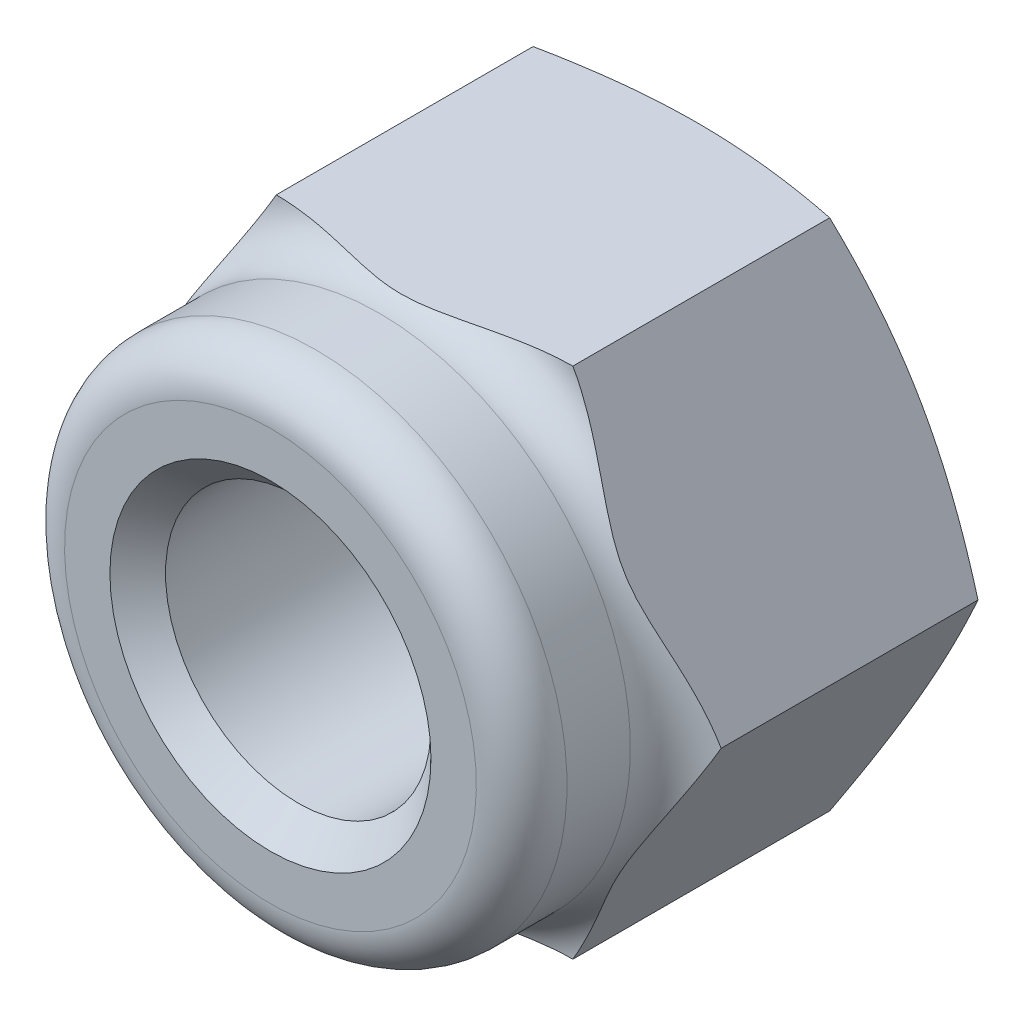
ISO-10303-21;
HEADER;
FILE_DESCRIPTION(('STEP AP214'),'2;1');
FILE_NAME('part.step','',(''),(''),'','','');
FILE_SCHEMA(('AUTOMOTIVE_DESIGN { 1 0 10303 214 1 1 1 1 }'));
ENDSEC;
DATA;
#1=APPLICATION_CONTEXT('core data for automotive mechanical design processes');
#2=APPLICATION_PROTOCOL_DEFINITION('international standard','automotive_design',2000,#1);
#3=PRODUCT_CONTEXT('',#1,'mechanical');
#4=PRODUCT('Part','Part','',(#3));
#5=PRODUCT_RELATED_PRODUCT_CATEGORY('part','',(#4));
#6=PRODUCT_DEFINITION_FORMATION('','',#4);
#7=PRODUCT_DEFINITION_CONTEXT('part definition',#1,'design');
#8=PRODUCT_DEFINITION('design','',#6,#7);
#9=PRODUCT_DEFINITION_SHAPE('','',#8);
#10=(LENGTH_UNIT() NAMED_UNIT(*) SI_UNIT(.MILLI.,.METRE.));
#11=(NAMED_UNIT(*) PLANE_ANGLE_UNIT() SI_UNIT($,.RADIAN.));
#12=(NAMED_UNIT(*) SI_UNIT($,.STERADIAN.) SOLID_ANGLE_UNIT());
#13=UNCERTAINTY_MEASURE_WITH_UNIT(LENGTH_MEASURE(1.E-05),#10,'distance_accuracy_value','');
#14=(GEOMETRIC_REPRESENTATION_CONTEXT(3) GLOBAL_UNCERTAINTY_ASSIGNED_CONTEXT((#13)) GLOBAL_UNIT_ASSIGNED_CONTEXT((#10,
#11,#12)) REPRESENTATION_CONTEXT('',''));
#15=CARTESIAN_POINT('',(0.,0.,0.));
#16=DIRECTION('',(0.,0.,1.));
#17=DIRECTION('',(1.,0.,0.));
#18=AXIS2_PLACEMENT_3D('',#15,#16,#17);
#19=CARTESIAN_POINT('',(0.,0.,0.));
#20=DIRECTION('',(0.,0.,1.));
#21=DIRECTION('',(0.,-1.,0.));
#22=AXIS2_PLACEMENT_3D('',#19,#20,#21);
#23=CONICAL_SURFACE('',#22,3.62876525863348,1.18682389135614);
#24=CARTESIAN_POINT('',(0.,0.,0.));
#25=DIRECTION('',(0.,0.,1.));
#26=DIRECTION('',(1.,0.,0.));
#27=AXIS2_PLACEMENT_3D('',#24,#25,#26);
#28=CIRCLE('',#27,3.62876525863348);
#29=CARTESIAN_POINT('',(3.62876525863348,0.,0.));
#30=VERTEX_POINT('',#29);
#31=EDGE_CURVE('E202',#30,#30,#28,.T.);
#32=ORIENTED_EDGE('',*,*,#31,.T.);
#33=EDGE_LOOP('',(#32));
#34=FACE_BOUND('',#33,.T.);
#35=CARTESIAN_POINT('',(2.30939988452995,3.99999833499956,0.400000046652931));
#36=CARTESIAN_POINT('',(2.39008408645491,3.86024919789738,0.367399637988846));
#37=CARTESIAN_POINT('',(2.47103459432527,3.72003880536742,0.337255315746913));
#38=CARTESIAN_POINT('',(2.63347088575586,3.43869089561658,0.28280533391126));
#39=CARTESIAN_POINT('',(2.71495695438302,3.29755288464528,0.258503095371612));
#40=CARTESIAN_POINT('',(2.8783483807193,3.0145506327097,0.21671027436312));
#41=CARTESIAN_POINT('',(2.96025360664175,2.8726866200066,0.199217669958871));
#42=CARTESIAN_POINT('',(3.12436830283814,2.58843162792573,0.171854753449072));
#43=CARTESIAN_POINT('',(3.20657770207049,2.44604077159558,0.161982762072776));
#44=CARTESIAN_POINT('',(3.36974497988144,2.16342675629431,0.150474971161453));
#45=CARTESIAN_POINT('',(3.45070040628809,2.02320784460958,0.148702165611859));
#46=CARTESIAN_POINT('',(3.61256341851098,1.7428528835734,0.153115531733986));
#47=CARTESIAN_POINT('',(3.69347099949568,1.60271684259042,0.159302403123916));
#48=CARTESIAN_POINT('',(3.85498924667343,1.32295903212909,0.179301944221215));
#49=CARTESIAN_POINT('',(3.93560007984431,1.18333697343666,0.193109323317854));
#50=CARTESIAN_POINT('',(4.09644627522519,0.904743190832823,0.227682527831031));
#51=CARTESIAN_POINT('',(4.17668163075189,0.765771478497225,0.248448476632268));
#52=CARTESIAN_POINT('',(4.28694558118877,0.574788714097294,0.281273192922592));
#53=CARTESIAN_POINT('',(4.31717509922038,0.522429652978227,0.290718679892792));
#54=CARTESIAN_POINT('',(4.37756278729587,0.417835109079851,0.310432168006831));
#55=CARTESIAN_POINT('',(4.40772096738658,0.36559960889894,0.32070004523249));
#56=CARTESIAN_POINT('',(4.46807171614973,0.261069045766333,0.342047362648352));
#57=CARTESIAN_POINT('',(4.49826404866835,0.208774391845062,0.353129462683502));
#58=CARTESIAN_POINT('',(4.55858256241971,0.104299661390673,0.376027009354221));
#59=CARTESIAN_POINT('',(4.58870873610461,0.0521195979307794,0.387842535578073));
#60=CARTESIAN_POINT('',(4.61880011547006,-2.00000000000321E-07,0.400000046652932));
#61=B_SPLINE_CURVE_WITH_KNOTS('',3,(#35,#36,#37,#38,#39,#40,#41,#42,#43,#44,#45,#46,#47,#48,#49,
#50,#51,#52,#53,#54,#55,#56,#57,#58,#59,#60),.UNSPECIFIED.,.F.,.F.,(4,2,2,2,2,2,2,2,2,2,2,2,4),
(0.,0.493920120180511,0.98812877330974,1.4821905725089,1.97614346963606,2.46170893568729,
2.94731708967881,3.43258852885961,3.91786857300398,4.10144236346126,4.28498854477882,
4.4691635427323,4.65335856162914),.UNSPECIFIED.);
#62=CARTESIAN_POINT('',(2.3094,3.99999813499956,0.4));
#63=VERTEX_POINT('',#62);
#64=CARTESIAN_POINT('',(4.6188,0.,0.4));
#65=VERTEX_POINT('',#64);
#66=EDGE_CURVE('E44',#63,#65,#61,.T.);
#67=ORIENTED_EDGE('',*,*,#66,.T.);
#68=CARTESIAN_POINT('',(4.61880011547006,2.E-07,0.400000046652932));
#69=CARTESIAN_POINT('',(4.53811591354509,-0.139748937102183,0.367399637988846));
#70=CARTESIAN_POINT('',(4.45716540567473,-0.279959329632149,0.337255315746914));
#71=CARTESIAN_POINT('',(4.29472911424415,-0.561307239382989,0.282805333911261));
#72=CARTESIAN_POINT('',(4.21324304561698,-0.702445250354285,0.258503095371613));
#73=CARTESIAN_POINT('',(4.0498516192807,-0.985447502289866,0.216710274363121));
#74=CARTESIAN_POINT('',(3.96794639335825,-1.12731151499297,0.199217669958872));
#75=CARTESIAN_POINT('',(3.80383169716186,-1.41156650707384,0.171854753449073));
#76=CARTESIAN_POINT('',(3.72162229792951,-1.55395736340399,0.161982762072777));
#77=CARTESIAN_POINT('',(3.55845502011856,-1.83657137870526,0.150474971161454));
#78=CARTESIAN_POINT('',(3.47749959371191,-1.97679029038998,0.148702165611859));
#79=CARTESIAN_POINT('',(3.31563658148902,-2.25714525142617,0.153115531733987));
#80=CARTESIAN_POINT('',(3.23472900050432,-2.39728129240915,0.159302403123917));
#81=CARTESIAN_POINT('',(3.07321075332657,-2.67703910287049,0.179301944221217));
#82=CARTESIAN_POINT('',(2.99259992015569,-2.81666116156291,0.193109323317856));
#83=CARTESIAN_POINT('',(2.83175372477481,-3.09525494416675,0.227682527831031));
#84=CARTESIAN_POINT('',(2.75151836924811,-3.23422665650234,0.248448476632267));
#85=CARTESIAN_POINT('',(2.64125441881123,-3.42520942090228,0.281273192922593));
#86=CARTESIAN_POINT('',(2.61102490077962,-3.47756848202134,0.290718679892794));
#87=CARTESIAN_POINT('',(2.55063721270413,-3.58216302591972,0.310432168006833));
#88=CARTESIAN_POINT('',(2.52047903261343,-3.63439852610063,0.320700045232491));
#89=CARTESIAN_POINT('',(2.46012828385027,-3.73892908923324,0.342047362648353));
#90=CARTESIAN_POINT('',(2.42993595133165,-3.79122374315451,0.353129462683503));
#91=CARTESIAN_POINT('',(2.36961743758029,-3.8956984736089,0.376027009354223));
#92=CARTESIAN_POINT('',(2.33949126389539,-3.94787853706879,0.387842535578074));
#93=CARTESIAN_POINT('',(2.30939988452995,-3.99999833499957,0.400000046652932));
#94=B_SPLINE_CURVE_WITH_KNOTS('',3,(#68,#69,#70,#71,#72,#73,#74,#75,#76,#77,#78,#79,#80,#81,#82,
#83,#84,#85,#86,#87,#88,#89,#90,#91,#92,#93),.UNSPECIFIED.,.F.,.F.,(4,2,2,2,2,2,2,2,2,2,2,2,4),
(0.,0.493920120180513,0.988128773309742,1.48219057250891,1.97614346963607,2.4617089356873,
2.94731708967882,3.43258852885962,3.91786857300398,4.10144236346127,4.28498854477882,
4.46916354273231,4.65335856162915),.UNSPECIFIED.);
#95=CARTESIAN_POINT('',(2.3094,-3.99999813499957,0.4));
#96=VERTEX_POINT('',#95);
#97=EDGE_CURVE('E37',#65,#96,#94,.T.);
#98=ORIENTED_EDGE('',*,*,#97,.T.);
#99=CARTESIAN_POINT('',(-6.1021503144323,-3.99999813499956,1.481786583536));
#100=CARTESIAN_POINT('',(-5.92175301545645,-3.99999813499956,1.42084763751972));
#101=CARTESIAN_POINT('',(-5.74111556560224,-3.99999813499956,1.36060648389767));
#102=CARTESIAN_POINT('',(-5.37923611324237,-3.99999813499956,1.24190964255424));
#103=CARTESIAN_POINT('',(-5.19799405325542,-3.99999813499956,1.18345413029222));
#104=CARTESIAN_POINT('',(-4.83437704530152,-3.99999813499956,1.06859174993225));
#105=CARTESIAN_POINT('',(-4.65200041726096,-3.99999813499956,1.01219018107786));
#106=CARTESIAN_POINT('',(-4.28642305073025,-3.99999813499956,0.902129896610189));
#107=CARTESIAN_POINT('',(-4.10322233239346,-3.99999813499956,0.848471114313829));
#108=CARTESIAN_POINT('',(-3.73820876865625,-3.99999813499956,0.745255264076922));
#109=CARTESIAN_POINT('',(-3.55640839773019,-3.99999813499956,0.69565430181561));
#110=CARTESIAN_POINT('',(-3.1917146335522,-3.99999813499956,0.6006505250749));
#111=CARTESIAN_POINT('',(-3.00882128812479,-3.99999813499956,0.555247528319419));
#112=CARTESIAN_POINT('',(-2.64189607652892,-3.99999813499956,0.469719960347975));
#113=CARTESIAN_POINT('',(-2.45786486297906,-3.99999813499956,0.429592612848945));
#114=CARTESIAN_POINT('',(-2.08849459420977,-3.99999813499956,0.355859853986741));
#115=CARTESIAN_POINT('',(-1.90315563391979,-3.99999813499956,0.322253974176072));
#116=CARTESIAN_POINT('',(-1.56923993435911,-3.99999813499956,0.269035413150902));
#117=CARTESIAN_POINT('',(-1.4208964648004,-3.99999813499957,0.247966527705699));
#118=CARTESIAN_POINT('',(-1.12351240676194,-3.99999813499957,0.211551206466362));
#119=CARTESIAN_POINT('',(-0.974471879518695,-3.99999813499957,0.19620427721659));
#120=CARTESIAN_POINT('',(-0.675960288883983,-3.99999813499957,0.171838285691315));
#121=CARTESIAN_POINT('',(-0.526489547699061,-3.99999813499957,0.162815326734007));
#122=CARTESIAN_POINT('',(-0.227291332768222,-3.99999813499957,0.151476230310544));
#123=CARTESIAN_POINT('',(-0.0775638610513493,-3.99999813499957,0.149160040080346));
#124=CARTESIAN_POINT('',(0.222566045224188,-3.99999813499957,0.151346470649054));
#125=CARTESIAN_POINT('',(0.372968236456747,-3.99999813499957,0.155882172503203));
#126=CARTESIAN_POINT('',(0.673420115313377,-3.99999813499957,0.1716249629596));
#127=CARTESIAN_POINT('',(0.823469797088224,-3.99999813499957,0.182832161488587));
#128=CARTESIAN_POINT('',(1.12306673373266,-3.99999813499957,0.211446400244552));
#129=CARTESIAN_POINT('',(1.27261360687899,-3.99999813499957,0.228857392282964));
#130=CARTESIAN_POINT('',(1.57094384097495,-3.99999813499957,0.26922725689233));
#131=CARTESIAN_POINT('',(1.71972720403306,-3.99999813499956,0.292186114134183));
#132=CARTESIAN_POINT('',(2.21449988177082,-3.99999813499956,0.376758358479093));
#133=CARTESIAN_POINT('',(2.55867405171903,-3.99999813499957,0.449066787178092));
#134=CARTESIAN_POINT('',(3.07171673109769,-3.99999813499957,0.570767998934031));
#135=CARTESIAN_POINT('',(3.24225211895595,-3.99999813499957,0.613558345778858));
#136=CARTESIAN_POINT('',(3.58238145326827,-3.99999813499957,0.702743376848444));
#137=CARTESIAN_POINT('',(3.75197543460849,-3.99999813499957,0.74913792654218));
#138=CARTESIAN_POINT('',(4.09077591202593,-3.99999813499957,0.844961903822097));
#139=CARTESIAN_POINT('',(4.25998022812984,-3.99999813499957,0.894398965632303));
#140=CARTESIAN_POINT('',(4.5976763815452,-3.99999813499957,0.995654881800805));
#141=CARTESIAN_POINT('',(4.76616820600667,-3.99999813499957,1.0474737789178));
#142=CARTESIAN_POINT('',(5.27063713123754,-3.99999813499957,1.20579281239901));
#143=CARTESIAN_POINT('',(5.60570586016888,-3.99999813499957,1.31518364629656));
#144=CARTESIAN_POINT('',(6.27182583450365,-3.99999813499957,1.53842679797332));
#145=CARTESIAN_POINT('',(6.60288893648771,-3.99999813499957,1.65224407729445));
#146=CARTESIAN_POINT('',(7.26376327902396,-3.99999813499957,1.88352740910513));
#147=CARTESIAN_POINT('',(7.59357442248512,-3.99999813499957,2.00099373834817));
#148=CARTESIAN_POINT('',(8.25006751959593,-3.99999813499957,2.237765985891));
#149=CARTESIAN_POINT('',(8.57675573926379,-3.99999813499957,2.35705459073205));
#150=CARTESIAN_POINT('',(9.22936398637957,-3.99999813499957,2.59758864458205));
#151=CARTESIAN_POINT('',(9.55528410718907,-3.99999813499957,2.71883384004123));
#152=CARTESIAN_POINT('',(9.88094687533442,-3.99999813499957,2.840755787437));
#153=B_SPLINE_CURVE_WITH_KNOTS('',3,(#99,#100,#101,#102,#103,#104,#105,#106,#107,#108,#109,#110,
#111,#112,#113,#114,#115,#116,#117,#118,#119,#120,#121,#122,#123,#124,#125,#126,#127,#128,#129,
#130,#131,#132,#133,#134,#135,#136,#137,#138,#139,#140,#141,#142,#143,#144,#145,#146,#147,#148,
#149,#150,#151,#152),.UNSPECIFIED.,.F.,.F.,(4,2,2,2,2,2,2,2,2,2,2,2,2,2,2,2,2,2,2,2,2,2,2,2,2,2,
4),(0.,0.571240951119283,1.14253785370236,1.71521709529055,2.28788240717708,2.85317896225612,
3.41845096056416,3.98342428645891,4.54835701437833,4.99775778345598,5.44711978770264,
5.89620466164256,6.34528600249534,6.7965424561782,7.2478063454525,7.69935820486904,
8.1509088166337,9.20509809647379,9.73255250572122,10.2599872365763,10.7888040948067,
11.3176304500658,12.374976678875,13.4251966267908,14.4754964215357,15.5188471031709,
16.5620636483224),.UNSPECIFIED.);
#154=CARTESIAN_POINT('',(-2.3094,-3.99999813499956,0.4));
#155=VERTEX_POINT('',#154);
#156=EDGE_CURVE('E82',#96,#155,#153,.F.);
#157=ORIENTED_EDGE('',*,*,#156,.T.);
#158=CARTESIAN_POINT('',(-2.30939988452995,-3.99999833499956,0.400000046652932));
#159=CARTESIAN_POINT('',(-2.39008408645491,-3.86024919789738,0.367399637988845));
#160=CARTESIAN_POINT('',(-2.47103459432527,-3.72003880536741,0.337255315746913));
#161=CARTESIAN_POINT('',(-2.63347088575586,-3.43869089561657,0.28280533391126));
#162=CARTESIAN_POINT('',(-2.71495695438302,-3.29755288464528,0.258503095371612));
#163=CARTESIAN_POINT('',(-2.8783483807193,-3.0145506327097,0.21671027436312));
#164=CARTESIAN_POINT('',(-2.96025360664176,-2.87268662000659,0.199217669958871));
#165=CARTESIAN_POINT('',(-3.12436830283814,-2.58843162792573,0.171854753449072));
#166=CARTESIAN_POINT('',(-3.20657770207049,-2.44604077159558,0.161982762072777));
#167=CARTESIAN_POINT('',(-3.36974497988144,-2.16342675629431,0.150474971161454));
#168=CARTESIAN_POINT('',(-3.4507004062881,-2.02320784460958,0.148702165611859));
#169=CARTESIAN_POINT('',(-3.61256341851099,-1.74285288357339,0.153115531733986));
#170=CARTESIAN_POINT('',(-3.69347099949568,-1.60271684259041,0.159302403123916));
#171=CARTESIAN_POINT('',(-3.85498924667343,-1.32295903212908,0.179301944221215));
#172=CARTESIAN_POINT('',(-3.93560007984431,-1.18333697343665,0.193109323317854));
#173=CARTESIAN_POINT('',(-4.09644627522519,-0.904743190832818,0.227682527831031));
#174=CARTESIAN_POINT('',(-4.17668163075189,-0.765771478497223,0.248448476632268));
#175=CARTESIAN_POINT('',(-4.28694558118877,-0.574788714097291,0.281273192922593));
#176=CARTESIAN_POINT('',(-4.31717509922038,-0.522429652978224,0.290718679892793));
#177=CARTESIAN_POINT('',(-4.37756278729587,-0.417835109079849,0.310432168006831));
#178=CARTESIAN_POINT('',(-4.40772096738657,-0.365599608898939,0.32070004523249));
#179=CARTESIAN_POINT('',(-4.46807171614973,-0.261069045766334,0.342047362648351));
#180=CARTESIAN_POINT('',(-4.49826404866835,-0.208774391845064,0.353129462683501));
#181=CARTESIAN_POINT('',(-4.55858256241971,-0.104299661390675,0.37602700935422));
#182=CARTESIAN_POINT('',(-4.58870873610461,-0.052119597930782,0.387842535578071));
#183=CARTESIAN_POINT('',(-4.61880011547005,1.99999998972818E-07,0.400000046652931));
#184=B_SPLINE_CURVE_WITH_KNOTS('',3,(#158,#159,#160,#161,#162,#163,#164,#165,#166,#167,#168,
#169,#170,#171,#172,#173,#174,#175,#176,#177,#178,#179,#180,#181,#182,#183),.UNSPECIFIED.,.F.,
.F.,(4,2,2,2,2,2,2,2,2,2,2,2,4),(0.,0.493920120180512,0.988128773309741,1.48219057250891,
1.97614346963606,2.46170893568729,2.94731708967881,3.43258852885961,3.91786857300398,
4.10144236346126,4.28498854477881,4.4691635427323,4.65335856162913),.UNSPECIFIED.);
#185=CARTESIAN_POINT('',(-4.6188,0.,0.4));
#186=VERTEX_POINT('',#185);
#187=EDGE_CURVE('E90',#155,#186,#184,.T.);
#188=ORIENTED_EDGE('',*,*,#187,.T.);
#189=CARTESIAN_POINT('',(-4.61880011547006,-2.00000001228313E-07,0.400000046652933));
#190=CARTESIAN_POINT('',(-4.53811591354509,0.139748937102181,0.367399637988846));
#191=CARTESIAN_POINT('',(-4.45716540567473,0.279959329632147,0.337255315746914));
#192=CARTESIAN_POINT('',(-4.29472911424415,0.561307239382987,0.28280533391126));
#193=CARTESIAN_POINT('',(-4.21324304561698,0.702445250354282,0.258503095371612));
#194=CARTESIAN_POINT('',(-4.0498516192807,0.985447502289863,0.21671027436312));
#195=CARTESIAN_POINT('',(-3.96794639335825,1.12731151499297,0.199217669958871));
#196=CARTESIAN_POINT('',(-3.80383169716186,1.41156650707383,0.171854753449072));
#197=CARTESIAN_POINT('',(-3.72162229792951,1.55395736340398,0.161982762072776));
#198=CARTESIAN_POINT('',(-3.55845502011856,1.83657137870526,0.150474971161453));
#199=CARTESIAN_POINT('',(-3.4774995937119,1.97679029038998,0.148702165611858));
#200=CARTESIAN_POINT('',(-3.31563658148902,2.25714525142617,0.153115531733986));
#201=CARTESIAN_POINT('',(-3.23472900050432,2.39728129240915,0.159302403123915));
#202=CARTESIAN_POINT('',(-3.07321075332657,2.67703910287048,0.179301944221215));
#203=CARTESIAN_POINT('',(-2.99259992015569,2.81666116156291,0.193109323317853));
#204=CARTESIAN_POINT('',(-2.83175372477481,3.09525494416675,0.22768252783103));
#205=CARTESIAN_POINT('',(-2.75151836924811,3.23422665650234,0.248448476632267));
#206=CARTESIAN_POINT('',(-2.64125441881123,3.42520942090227,0.281273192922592));
#207=CARTESIAN_POINT('',(-2.61102490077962,3.47756848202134,0.290718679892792));
#208=CARTESIAN_POINT('',(-2.55063721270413,3.58216302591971,0.310432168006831));
#209=CARTESIAN_POINT('',(-2.52047903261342,3.63439852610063,0.32070004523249));
#210=CARTESIAN_POINT('',(-2.46012828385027,3.73892908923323,0.342047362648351));
#211=CARTESIAN_POINT('',(-2.42993595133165,3.7912237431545,0.353129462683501));
#212=CARTESIAN_POINT('',(-2.36961743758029,3.89569847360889,0.37602700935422));
#213=CARTESIAN_POINT('',(-2.33949126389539,3.94787853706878,0.387842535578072));
#214=CARTESIAN_POINT('',(-2.30939988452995,3.99999833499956,0.400000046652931));
#215=B_SPLINE_CURVE_WITH_KNOTS('',3,(#189,#190,#191,#192,#193,#194,#195,#196,#197,#198,#199,
#200,#201,#202,#203,#204,#205,#206,#207,#208,#209,#210,#211,#212,#213,#214),.UNSPECIFIED.,.F.,
.F.,(4,2,2,2,2,2,2,2,2,2,2,2,4),(0.,0.493920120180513,0.988128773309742,1.48219057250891,
1.97614346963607,2.4617089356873,2.94731708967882,3.43258852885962,3.91786857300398,
4.10144236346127,4.28498854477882,4.46916354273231,4.65335856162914),.UNSPECIFIED.);
#216=CARTESIAN_POINT('',(-2.3094,3.99999813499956,0.4));
#217=VERTEX_POINT('',#216);
#218=EDGE_CURVE('E95',#186,#217,#215,.T.);
#219=ORIENTED_EDGE('',*,*,#218,.T.);
#220=CARTESIAN_POINT('',(-6.1021503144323,3.99999813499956,1.481786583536));
#221=CARTESIAN_POINT('',(-5.92175301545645,3.99999813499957,1.42084763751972));
#222=CARTESIAN_POINT('',(-5.74111556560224,3.99999813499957,1.36060648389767));
#223=CARTESIAN_POINT('',(-5.37923611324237,3.99999813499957,1.24190964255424));
#224=CARTESIAN_POINT('',(-5.19799405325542,3.99999813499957,1.18345413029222));
#225=CARTESIAN_POINT('',(-4.83437704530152,3.99999813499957,1.06859174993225));
#226=CARTESIAN_POINT('',(-4.65200041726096,3.99999813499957,1.01219018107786));
#227=CARTESIAN_POINT('',(-4.28642305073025,3.99999813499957,0.902129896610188));
#228=CARTESIAN_POINT('',(-4.10322233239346,3.99999813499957,0.848471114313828));
#229=CARTESIAN_POINT('',(-3.73820876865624,3.99999813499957,0.745255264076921));
#230=CARTESIAN_POINT('',(-3.55640839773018,3.99999813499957,0.69565430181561));
#231=CARTESIAN_POINT('',(-3.1917146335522,3.99999813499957,0.6006505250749));
#232=CARTESIAN_POINT('',(-3.00882128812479,3.99999813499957,0.555247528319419));
#233=CARTESIAN_POINT('',(-2.64189607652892,3.99999813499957,0.469719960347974));
#234=CARTESIAN_POINT('',(-2.45786486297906,3.99999813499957,0.429592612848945));
#235=CARTESIAN_POINT('',(-2.08849459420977,3.99999813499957,0.35585985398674));
#236=CARTESIAN_POINT('',(-1.90315563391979,3.99999813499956,0.322253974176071));
#237=CARTESIAN_POINT('',(-1.56923993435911,3.99999813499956,0.269035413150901));
#238=CARTESIAN_POINT('',(-1.4208964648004,3.99999813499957,0.247966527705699));
#239=CARTESIAN_POINT('',(-1.12351240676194,3.99999813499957,0.211551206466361));
#240=CARTESIAN_POINT('',(-0.974471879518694,3.99999813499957,0.196204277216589));
#241=CARTESIAN_POINT('',(-0.675960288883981,3.99999813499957,0.171838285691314));
#242=CARTESIAN_POINT('',(-0.52648954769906,3.99999813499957,0.162815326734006));
#243=CARTESIAN_POINT('',(-0.227291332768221,3.99999813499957,0.151476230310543));
#244=CARTESIAN_POINT('',(-0.0775638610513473,3.99999813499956,0.149160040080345));
#245=CARTESIAN_POINT('',(0.22256604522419,3.99999813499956,0.151346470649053));
#246=CARTESIAN_POINT('',(0.37296823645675,3.99999813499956,0.155882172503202));
#247=CARTESIAN_POINT('',(0.673420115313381,3.99999813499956,0.171624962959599));
#248=CARTESIAN_POINT('',(0.823469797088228,3.99999813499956,0.182832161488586));
#249=CARTESIAN_POINT('',(1.12306673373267,3.99999813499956,0.211446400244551));
#250=CARTESIAN_POINT('',(1.27261360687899,3.99999813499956,0.228857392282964));
#251=CARTESIAN_POINT('',(1.57094384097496,3.99999813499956,0.269227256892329));
#252=CARTESIAN_POINT('',(1.71972720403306,3.99999813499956,0.292186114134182));
#253=CARTESIAN_POINT('',(2.21449988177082,3.99999813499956,0.376758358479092));
#254=CARTESIAN_POINT('',(2.55867405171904,3.99999813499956,0.449066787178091));
#255=CARTESIAN_POINT('',(3.0717167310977,3.99999813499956,0.570767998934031));
#256=CARTESIAN_POINT('',(3.24225211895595,3.99999813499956,0.613558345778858));
#257=CARTESIAN_POINT('',(3.58238145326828,3.99999813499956,0.702743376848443));
#258=CARTESIAN_POINT('',(3.7519754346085,3.99999813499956,0.74913792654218));
#259=CARTESIAN_POINT('',(4.09077591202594,3.99999813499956,0.844961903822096));
#260=CARTESIAN_POINT('',(4.25998022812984,3.99999813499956,0.894398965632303));
#261=CARTESIAN_POINT('',(4.5976763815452,3.99999813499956,0.995654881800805));
#262=CARTESIAN_POINT('',(4.76616820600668,3.99999813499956,1.0474737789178));
#263=CARTESIAN_POINT('',(5.27063713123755,3.99999813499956,1.20579281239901));
#264=CARTESIAN_POINT('',(5.60570586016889,3.99999813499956,1.31518364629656));
#265=CARTESIAN_POINT('',(6.27182583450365,3.99999813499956,1.53842679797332));
#266=CARTESIAN_POINT('',(6.60288893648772,3.99999813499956,1.65224407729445));
#267=CARTESIAN_POINT('',(7.26376327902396,3.99999813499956,1.88352740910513));
#268=CARTESIAN_POINT('',(7.59357442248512,3.99999813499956,2.00099373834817));
#269=CARTESIAN_POINT('',(8.25006751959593,3.99999813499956,2.237765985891));
#270=CARTESIAN_POINT('',(8.57675573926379,3.99999813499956,2.35705459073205));
#271=CARTESIAN_POINT('',(9.22936398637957,3.99999813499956,2.59758864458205));
#272=CARTESIAN_POINT('',(9.55528410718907,3.99999813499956,2.71883384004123));
#273=CARTESIAN_POINT('',(9.88094687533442,3.99999813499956,2.840755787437));
#274=B_SPLINE_CURVE_WITH_KNOTS('',3,(#220,#221,#222,#223,#224,#225,#226,#227,#228,#229,#230,
#231,#232,#233,#234,#235,#236,#237,#238,#239,#240,#241,#242,#243,#244,#245,#246,#247,#248,#249,
#250,#251,#252,#253,#254,#255,#256,#257,#258,#259,#260,#261,#262,#263,#264,#265,#266,#267,#268,
#269,#270,#271,#272,#273),.UNSPECIFIED.,.F.,.F.,(4,2,2,2,2,2,2,2,2,2,2,2,2,2,2,2,2,2,2,2,2,2,2,
2,2,2,4),(0.,0.571240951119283,1.14253785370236,1.71521709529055,2.28788240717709,
2.85317896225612,3.41845096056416,3.98342428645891,4.54835701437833,4.99775778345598,
5.44711978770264,5.89620466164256,6.34528600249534,6.7965424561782,7.2478063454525,
7.69935820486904,8.1509088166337,9.20509809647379,9.73255250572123,10.2599872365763,
10.7888040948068,11.3176304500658,12.374976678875,13.4251966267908,14.4754964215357,
15.5188471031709,16.5620636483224),.UNSPECIFIED.);
#275=EDGE_CURVE('E180',#217,#63,#274,.T.);
#276=ORIENTED_EDGE('',*,*,#275,.T.);
#277=EDGE_LOOP('',(#67,#98,#157,#188,#219,#276));
#278=FACE_BOUND('',#277,.T.);
#279=ADVANCED_FACE('F17',(#34,#278),#23,.T.);
#280=CARTESIAN_POINT('',(4.6188,0.,0.));
#281=DIRECTION('',(0.,0.,1.));
#282=DIRECTION('',(1.,0.,0.));
#283=AXIS2_PLACEMENT_3D('',#280,#281,#282);
#284=PLANE('',#283);
#285=CARTESIAN_POINT('',(0.,0.,0.));
#286=DIRECTION('',(0.,0.,1.));
#287=DIRECTION('',(1.,0.,0.));
#288=AXIS2_PLACEMENT_3D('',#285,#286,#287);
#289=CIRCLE('',#288,2.5);
#290=CARTESIAN_POINT('',(2.5,0.,0.));
#291=VERTEX_POINT('',#290);
#292=EDGE_CURVE('E205',#291,#291,#289,.F.);
#293=ORIENTED_EDGE('',*,*,#292,.F.);
#294=EDGE_LOOP('',(#293));
#295=FACE_BOUND('',#294,.T.);
#296=ORIENTED_EDGE('',*,*,#31,.F.);
#297=EDGE_LOOP('',(#296));
#298=FACE_BOUND('',#297,.T.);
#299=ADVANCED_FACE('F224',(#295,#298),#284,.F.);
#300=CARTESIAN_POINT('',(0.,0.,6.8));
#301=DIRECTION('',(0.,0.,1.));
#302=DIRECTION('',(0.,-1.,0.));
#303=AXIS2_PLACEMENT_3D('',#300,#301,#302);
#304=CONICAL_SURFACE('',#303,2.5,0.785398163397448);
#305=CARTESIAN_POINT('',(0.,0.,6.367));
#306=DIRECTION('',(0.,0.,-1.));
#307=DIRECTION('',(0.,1.,0.));
#308=AXIS2_PLACEMENT_3D('',#305,#306,#307);
#309=CIRCLE('',#308,2.067);
#310=CARTESIAN_POINT('',(0.,2.067,6.367));
#311=VERTEX_POINT('',#310);
#312=EDGE_CURVE('E244',#311,#311,#309,.T.);
#313=ORIENTED_EDGE('',*,*,#312,.T.);
#314=EDGE_LOOP('',(#313));
#315=FACE_BOUND('',#314,.T.);
#316=CARTESIAN_POINT('',(0.,0.,6.8));
#317=DIRECTION('',(0.,0.,-1.));
#318=DIRECTION('',(0.,1.,0.));
#319=AXIS2_PLACEMENT_3D('',#316,#317,#318);
#320=CIRCLE('',#319,2.5);
#321=CARTESIAN_POINT('',(0.,2.5,6.8));
#322=VERTEX_POINT('',#321);
#323=EDGE_CURVE('E247',#322,#322,#320,.T.);
#324=ORIENTED_EDGE('',*,*,#323,.F.);
#325=EDGE_LOOP('',(#324));
#326=FACE_BOUND('',#325,.T.);
#327=ADVANCED_FACE('F229',(#315,#326),#304,.F.);
#328=CARTESIAN_POINT('',(0.,0.,0.));
#329=DIRECTION('',(0.,0.,-1.));
#330=DIRECTION('',(0.,1.,0.));
#331=AXIS2_PLACEMENT_3D('',#328,#329,#330);
#332=CYLINDRICAL_SURFACE('',#331,2.067);
#333=CARTESIAN_POINT('',(0.,0.,0.433));
#334=DIRECTION('',(0.,0.,-1.));
#335=DIRECTION('',(0.,1.,0.));
#336=AXIS2_PLACEMENT_3D('',#333,#334,#335);
#337=CIRCLE('',#336,2.067);
#338=CARTESIAN_POINT('',(0.,2.067,0.433));
#339=VERTEX_POINT('',#338);
#340=EDGE_CURVE('E242',#339,#339,#337,.T.);
#341=ORIENTED_EDGE('',*,*,#340,.T.);
#342=EDGE_LOOP('',(#341));
#343=FACE_BOUND('',#342,.T.);
#344=ORIENTED_EDGE('',*,*,#312,.F.);
#345=EDGE_LOOP('',(#344));
#346=FACE_BOUND('',#345,.T.);
#347=ADVANCED_FACE('F220',(#343,#346),#332,.F.);
#348=CARTESIAN_POINT('',(0.,0.,0.433));
#349=DIRECTION('',(0.,0.,-1.));
#350=DIRECTION('',(0.,1.,0.));
#351=AXIS2_PLACEMENT_3D('',#348,#349,#350);
#352=CONICAL_SURFACE('',#351,2.067,0.785398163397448);
#353=ORIENTED_EDGE('',*,*,#292,.T.);
#354=EDGE_LOOP('',(#353));
#355=FACE_BOUND('',#354,.T.);
#356=ORIENTED_EDGE('',*,*,#340,.F.);
#357=EDGE_LOOP('',(#356));
#358=FACE_BOUND('',#357,.T.);
#359=ADVANCED_FACE('F214',(#355,#358),#352,.F.);
#360=CARTESIAN_POINT('',(4.6188,0.,6.8));
#361=DIRECTION('',(0.,0.,1.));
#362=DIRECTION('',(1.,0.,0.));
#363=AXIS2_PLACEMENT_3D('',#360,#361,#362);
#364=PLANE('',#363);
#365=ORIENTED_EDGE('',*,*,#323,.T.);
#366=EDGE_LOOP('',(#365));
#367=FACE_BOUND('',#366,.T.);
#368=CARTESIAN_POINT('',(0.,0.,6.8));
#369=DIRECTION('',(0.,0.,-1.));
#370=DIRECTION('',(0.,1.,0.));
#371=AXIS2_PLACEMENT_3D('',#368,#369,#370);
#372=CIRCLE('',#371,3.20626666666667);
#373=CARTESIAN_POINT('',(0.,3.20626666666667,6.8));
#374=VERTEX_POINT('',#373);
#375=EDGE_CURVE('E30',#374,#374,#372,.T.);
#376=ORIENTED_EDGE('',*,*,#375,.F.);
#377=EDGE_LOOP('',(#376));
#378=FACE_BOUND('',#377,.T.);
#379=ADVANCED_FACE('F117',(#367,#378),#364,.T.);
#380=CARTESIAN_POINT('',(0.,0.,5.10626666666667));
#381=DIRECTION('',(0.,0.,-1.));
#382=DIRECTION('',(0.,1.,0.));
#383=AXIS2_PLACEMENT_3D('',#380,#381,#382);
#384=TOROIDAL_SURFACE('',#383,4.6188,0.706266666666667);
#385=CARTESIAN_POINT('',(0.,0.,5.10626666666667));
#386=DIRECTION('',(0.,0.,-1.));
#387=DIRECTION('',(0.,1.,0.));
#388=AXIS2_PLACEMENT_3D('',#385,#386,#387);
#389=CIRCLE('',#388,3.91253333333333);
#390=CARTESIAN_POINT('',(0.,3.91253333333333,5.10626666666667));
#391=VERTEX_POINT('',#390);
#392=EDGE_CURVE('E97',#391,#391,#389,.T.);
#393=ORIENTED_EDGE('',*,*,#392,.T.);
#394=EDGE_LOOP('',(#393));
#395=FACE_BOUND('',#394,.T.);
#396=CARTESIAN_POINT('',(4.61880011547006,2.E-07,4.4));
#397=CARTESIAN_POINT('',(4.59108597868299,-0.0480020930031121,4.4000099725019));
#398=CARTESIAN_POINT('',(4.56338581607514,-0.0959801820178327,4.40162976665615));
#399=CARTESIAN_POINT('',(4.50808143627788,-0.191770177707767,4.40764111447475));
#400=CARTESIAN_POINT('',(4.48047715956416,-0.239582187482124,4.4120304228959));
#401=CARTESIAN_POINT('',(4.39809181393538,-0.382277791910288,4.42863614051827));
#402=CARTESIAN_POINT('',(4.34348697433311,-0.476856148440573,4.4442985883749));
#403=CARTESIAN_POINT('',(4.23454795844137,-0.665544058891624,4.48200198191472));
#404=CARTESIAN_POINT('',(4.1802170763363,-0.759647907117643,4.5040786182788));
#405=CARTESIAN_POINT('',(4.07185504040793,-0.947336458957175,4.55181790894));
#406=CARTESIAN_POINT('',(4.01782468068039,-1.0409197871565,4.57748749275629));
#407=CARTESIAN_POINT('',(3.90985295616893,-1.22793229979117,4.62911876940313));
#408=CARTESIAN_POINT('',(3.85591155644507,-1.32136154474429,4.65508014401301));
#409=CARTESIAN_POINT('',(3.77467402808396,-1.46206907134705,4.69062692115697));
#410=CARTESIAN_POINT('',(3.74756881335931,-1.5090166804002,4.70190005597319));
#411=CARTESIAN_POINT('',(3.6931653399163,-1.60324626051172,4.72246979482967));
#412=CARTESIAN_POINT('',(3.66586707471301,-1.65052824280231,4.73176633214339));
#413=CARTESIAN_POINT('',(3.61104518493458,-1.74548254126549,4.74743841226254));
#414=CARTESIAN_POINT('',(3.58352149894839,-1.79315496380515,4.75381313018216));
#415=CARTESIAN_POINT('',(3.52832245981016,-1.88876250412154,4.76274994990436));
#416=CARTESIAN_POINT('',(3.5006471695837,-1.93669751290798,4.76531352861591));
#417=CARTESIAN_POINT('',(3.44526719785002,-2.03261843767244,4.76620468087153));
#418=CARTESIAN_POINT('',(3.41756250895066,-2.08060436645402,4.76453052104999));
#419=CARTESIAN_POINT('',(3.36228212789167,-2.17635279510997,4.75722651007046));
#420=CARTESIAN_POINT('',(3.33470647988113,-2.22411521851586,4.75159539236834));
#421=CARTESIAN_POINT('',(3.26689962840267,-2.34156013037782,4.73382929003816));
#422=CARTESIAN_POINT('',(3.22679211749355,-2.41102837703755,4.71988321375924));
#423=CARTESIAN_POINT('',(3.14695395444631,-2.54931213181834,4.68824762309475));
#424=CARTESIAN_POINT('',(3.10722351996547,-2.61812726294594,4.6705560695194));
#425=CARTESIAN_POINT('',(3.02779390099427,-2.75570339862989,4.63374689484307));
#426=CARTESIAN_POINT('',(2.98809525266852,-2.82446347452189,4.61462475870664));
#427=CARTESIAN_POINT('',(2.90866312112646,-2.96204396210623,4.57671369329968));
#428=CARTESIAN_POINT('',(2.8689296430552,-3.03086436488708,4.55792472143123));
#429=CARTESIAN_POINT('',(2.78648783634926,-3.17365776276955,4.52073895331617));
#430=CARTESIAN_POINT('',(2.74376567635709,-3.24765471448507,4.50246134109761));
#431=CARTESIAN_POINT('',(2.65801785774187,-3.39617429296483,4.46920440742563));
#432=CARTESIAN_POINT('',(2.6149923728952,-3.47069661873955,4.4542233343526));
#433=CARTESIAN_POINT('',(2.52839617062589,-3.62068564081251,4.42887531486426));
#434=CARTESIAN_POINT('',(2.48482390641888,-3.69615501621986,4.41852842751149));
#435=CARTESIAN_POINT('',(2.41922118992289,-3.80978225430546,4.40770270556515));
#436=CARTESIAN_POINT('',(2.39728745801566,-3.84777259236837,4.40487602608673));
#437=CARTESIAN_POINT('',(2.35337123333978,-3.9238377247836,4.40102633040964));
#438=CARTESIAN_POINT('',(2.33138872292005,-3.96191254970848,4.40000413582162));
#439=CARTESIAN_POINT('',(2.30939988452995,-3.99999833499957,4.4));
#440=B_SPLINE_CURVE_WITH_KNOTS('',3,(#396,#397,#398,#399,#400,#401,#402,#403,#404,#405,#406,
#407,#408,#409,#410,#411,#412,#413,#414,#415,#416,#417,#418,#419,#420,#421,#422,#423,#424,#425,
#426,#427,#428,#429,#430,#431,#432,#433,#434,#435,#436,#437,#438,#439),.UNSPECIFIED.,.F.,.F.,(4,
2,2,2,2,2,2,2,2,2,2,2,2,2,2,2,2,2,2,2,2,4),(0.,0.166220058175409,0.332305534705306,
0.662974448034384,0.995519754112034,1.32871549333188,1.66157760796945,1.82766548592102,
1.99375896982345,2.15989931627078,2.32597526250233,2.49211914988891,2.65831624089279,
2.90237892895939,3.14657483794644,3.39157690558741,3.63654741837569,3.89863876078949,
4.16059050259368,4.42366539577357,4.5555073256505,4.68740926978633),.UNSPECIFIED.);
#441=CARTESIAN_POINT('',(4.6188,0.,4.4));
#442=VERTEX_POINT('',#441);
#443=CARTESIAN_POINT('',(2.3094,-3.99999813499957,4.4));
#444=VERTEX_POINT('',#443);
#445=EDGE_CURVE('E165',#442,#444,#440,.T.);
#446=ORIENTED_EDGE('',*,*,#445,.F.);
#447=CARTESIAN_POINT('',(2.30939988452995,3.99999833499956,4.4));
#448=CARTESIAN_POINT('',(2.33711402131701,3.95199604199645,4.4000099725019));
#449=CARTESIAN_POINT('',(2.36481418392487,3.90401795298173,4.40162976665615));
#450=CARTESIAN_POINT('',(2.42011856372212,3.8082279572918,4.40764111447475));
#451=CARTESIAN_POINT('',(2.44772284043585,3.76041594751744,4.4120304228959));
#452=CARTESIAN_POINT('',(2.53010818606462,3.61772034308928,4.42863614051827));
#453=CARTESIAN_POINT('',(2.58471302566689,3.52314198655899,4.44429858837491));
#454=CARTESIAN_POINT('',(2.69365204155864,3.33445407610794,4.48200198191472));
#455=CARTESIAN_POINT('',(2.74798292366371,3.24035022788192,4.5040786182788));
#456=CARTESIAN_POINT('',(2.85634495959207,3.05266167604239,4.55181790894));
#457=CARTESIAN_POINT('',(2.91037531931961,2.95907834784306,4.57748749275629));
#458=CARTESIAN_POINT('',(3.01834704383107,2.7720658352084,4.62911876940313));
#459=CARTESIAN_POINT('',(3.07228844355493,2.67863659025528,4.65508014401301));
#460=CARTESIAN_POINT('',(3.15352597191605,2.53792906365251,4.69062692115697));
#461=CARTESIAN_POINT('',(3.18063118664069,2.49098145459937,4.70190005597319));
#462=CARTESIAN_POINT('',(3.2350346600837,2.39675187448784,4.72246979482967));
#463=CARTESIAN_POINT('',(3.26233292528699,2.34946989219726,4.73176633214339));
#464=CARTESIAN_POINT('',(3.31715481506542,2.25451559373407,4.74743841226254));
#465=CARTESIAN_POINT('',(3.34467850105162,2.20684317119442,4.75381313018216));
#466=CARTESIAN_POINT('',(3.39987754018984,2.11123563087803,4.76274994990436));
#467=CARTESIAN_POINT('',(3.4275528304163,2.06330062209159,4.76531352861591));
#468=CARTESIAN_POINT('',(3.48293280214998,1.96737969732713,4.76620468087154));
#469=CARTESIAN_POINT('',(3.51063749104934,1.91939376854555,4.76453052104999));
#470=CARTESIAN_POINT('',(3.56591787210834,1.8236453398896,4.75722651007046));
#471=CARTESIAN_POINT('',(3.59349352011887,1.77588291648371,4.75159539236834));
#472=CARTESIAN_POINT('',(3.66130037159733,1.65843800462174,4.73382929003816));
#473=CARTESIAN_POINT('',(3.70140788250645,1.58896975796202,4.71988321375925));
#474=CARTESIAN_POINT('',(3.7812460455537,1.45068600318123,4.68824762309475));
#475=CARTESIAN_POINT('',(3.82097648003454,1.38187087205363,4.6705560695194));
#476=CARTESIAN_POINT('',(3.90040609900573,1.24429473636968,4.63374689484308));
#477=CARTESIAN_POINT('',(3.94010474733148,1.17553466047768,4.61462475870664));
#478=CARTESIAN_POINT('',(4.01953687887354,1.03795417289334,4.57671369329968));
#479=CARTESIAN_POINT('',(4.0592703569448,0.969133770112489,4.55792472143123));
#480=CARTESIAN_POINT('',(4.14171216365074,0.826340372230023,4.52073895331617));
#481=CARTESIAN_POINT('',(4.18443432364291,0.752343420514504,4.50246134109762));
#482=CARTESIAN_POINT('',(4.27018214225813,0.603823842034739,4.46920440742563));
#483=CARTESIAN_POINT('',(4.3132076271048,0.52930151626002,4.4542233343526));
#484=CARTESIAN_POINT('',(4.39980382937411,0.379312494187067,4.42887531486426));
#485=CARTESIAN_POINT('',(4.44337609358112,0.303843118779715,4.41852842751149));
#486=CARTESIAN_POINT('',(4.50897881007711,0.190215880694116,4.40770270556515));
#487=CARTESIAN_POINT('',(4.53091254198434,0.152225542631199,4.40487602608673));
#488=CARTESIAN_POINT('',(4.57482876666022,0.0761604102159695,4.40102633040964));
#489=CARTESIAN_POINT('',(4.59681127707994,0.0380855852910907,4.40000413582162));
#490=CARTESIAN_POINT('',(4.61880011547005,-1.99999999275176E-07,4.4));
#491=B_SPLINE_CURVE_WITH_KNOTS('',3,(#447,#448,#449,#450,#451,#452,#453,#454,#455,#456,#457,
#458,#459,#460,#461,#462,#463,#464,#465,#466,#467,#468,#469,#470,#471,#472,#473,#474,#475,#476,
#477,#478,#479,#480,#481,#482,#483,#484,#485,#486,#487,#488,#489,#490),.UNSPECIFIED.,.F.,.F.,(4,
2,2,2,2,2,2,2,2,2,2,2,2,2,2,2,2,2,2,2,2,4),(0.,0.166220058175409,0.332305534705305,
0.662974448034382,0.995519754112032,1.32871549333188,1.66157760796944,1.82766548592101,
1.99375896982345,2.15989931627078,2.32597526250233,2.49211914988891,2.65831624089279,
2.90237892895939,3.14657483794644,3.39157690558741,3.63654741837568,3.89863876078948,
4.16059050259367,4.42366539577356,4.55550732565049,4.68740926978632),.UNSPECIFIED.);
#492=CARTESIAN_POINT('',(2.3094,3.99999813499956,4.4));
#493=VERTEX_POINT('',#492);
#494=EDGE_CURVE('E160',#493,#442,#491,.T.);
#495=ORIENTED_EDGE('',*,*,#494,.F.);
#496=CARTESIAN_POINT('',(0.,3.99999813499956,4.76583039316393));
#497=CARTESIAN_POINT('',(0.0450662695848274,3.99999813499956,4.76583606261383));
#498=CARTESIAN_POINT('',(0.0901280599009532,3.99999813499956,4.76443411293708));
#499=CARTESIAN_POINT('',(0.180096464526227,3.99999813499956,4.75899848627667));
#500=CARTESIAN_POINT('',(0.225003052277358,3.99999813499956,4.75496437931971));
#501=CARTESIAN_POINT('',(0.359626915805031,3.99999813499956,4.73946985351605));
#502=CARTESIAN_POINT('',(0.448941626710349,3.99999813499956,4.72462175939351));
#503=CARTESIAN_POINT('',(0.62783342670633,3.99999813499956,4.68982360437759));
#504=CARTESIAN_POINT('',(0.71739507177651,3.99999813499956,4.66980175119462));
#505=CARTESIAN_POINT('',(0.896032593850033,3.99999813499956,4.62821698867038));
#506=CARTESIAN_POINT('',(0.985108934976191,3.99999813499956,4.60665601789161));
#507=CARTESIAN_POINT('',(1.15470711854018,3.99999813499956,4.56635555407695));
#508=CARTESIAN_POINT('',(1.23521165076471,3.99999813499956,4.54754665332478));
#509=CARTESIAN_POINT('',(1.39666982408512,3.99999813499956,4.51185042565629));
#510=CARTESIAN_POINT('',(1.47762361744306,3.99999813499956,4.49496379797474));
#511=CARTESIAN_POINT('',(1.72057538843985,3.99999813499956,4.44908829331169));
#512=CARTESIAN_POINT('',(1.88354642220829,3.99999813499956,4.42464665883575));
#513=CARTESIAN_POINT('',(2.16424516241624,3.99999813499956,4.40160749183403));
#514=CARTESIAN_POINT('',(2.2814487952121,3.99999813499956,4.39758530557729));
#515=CARTESIAN_POINT('',(2.45684816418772,3.99999813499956,4.40337215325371));
#516=CARTESIAN_POINT('',(2.5152327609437,3.99999813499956,4.40726873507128));
#517=CARTESIAN_POINT('',(2.63148232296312,3.99999813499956,4.4197492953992));
#518=CARTESIAN_POINT('',(2.6893476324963,3.99999813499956,4.42832989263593));
#519=CARTESIAN_POINT('',(2.80658472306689,3.99999813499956,4.4515693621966));
#520=CARTESIAN_POINT('',(2.86590743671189,3.99999813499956,4.46648392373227));
#521=CARTESIAN_POINT('',(2.98227782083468,3.99999813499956,4.50363403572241));
#522=CARTESIAN_POINT('',(3.03932673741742,3.99999813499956,4.52586551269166));
#523=CARTESIAN_POINT('',(3.13786107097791,3.99999813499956,4.57358581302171));
#524=CARTESIAN_POINT('',(3.18012441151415,3.99999813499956,4.59744895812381));
#525=CARTESIAN_POINT('',(3.26046237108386,3.99999813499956,4.65145769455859));
#526=CARTESIAN_POINT('',(3.29854469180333,3.99999813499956,4.68159142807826));
#527=CARTESIAN_POINT('',(3.35757728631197,3.99999813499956,4.73840853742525));
#528=CARTESIAN_POINT('',(3.38020907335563,3.99999813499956,4.76333826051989));
#529=CARTESIAN_POINT('',(3.42128517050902,3.99999813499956,4.81645310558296));
#530=CARTESIAN_POINT('',(3.43973478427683,3.99999813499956,4.8446340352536));
#531=CARTESIAN_POINT('',(3.46871631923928,3.99999813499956,4.8991055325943));
#532=CARTESIAN_POINT('',(3.48004480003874,3.99999813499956,4.92496981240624));
#533=CARTESIAN_POINT('',(3.49822719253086,3.99999813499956,4.97823527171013));
#534=CARTESIAN_POINT('',(3.50508368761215,3.99999813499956,5.00563555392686));
#535=CARTESIAN_POINT('',(3.5138404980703,3.99999813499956,5.06134531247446));
#536=CARTESIAN_POINT('',(3.51572015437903,3.99999813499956,5.08965808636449));
#537=CARTESIAN_POINT('',(3.51430929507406,3.99999813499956,5.14615294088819));
#538=CARTESIAN_POINT('',(3.51101895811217,3.99999813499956,5.17433502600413));
#539=CARTESIAN_POINT('',(3.49992079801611,3.99999813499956,5.22781232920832));
#540=CARTESIAN_POINT('',(3.49242933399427,3.99999813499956,5.25317465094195));
#541=CARTESIAN_POINT('',(3.47364853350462,3.99999813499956,5.3024390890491));
#542=CARTESIAN_POINT('',(3.46235793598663,3.99999813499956,5.3263407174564));
#543=CARTESIAN_POINT('',(3.43194734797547,3.99999813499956,5.3805182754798));
#544=CARTESIAN_POINT('',(3.41147104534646,3.99999813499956,5.41003291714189));
#545=CARTESIAN_POINT('',(3.36600807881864,3.99999813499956,5.46535028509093));
#546=CARTESIAN_POINT('',(3.34101267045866,3.99999813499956,5.4911456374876));
#547=CARTESIAN_POINT('',(3.2763137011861,3.99999813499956,5.5492960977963));
#548=CARTESIAN_POINT('',(3.23489400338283,3.99999813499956,5.57973303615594));
#549=CARTESIAN_POINT('',(3.14786384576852,3.99999813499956,5.63378572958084));
#550=CARTESIAN_POINT('',(3.10224557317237,3.99999813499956,5.65738841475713));
#551=CARTESIAN_POINT('',(2.9795387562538,3.99999813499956,5.71140691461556));
#552=CARTESIAN_POINT('',(2.9003729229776,3.99999813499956,5.73706499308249));
#553=CARTESIAN_POINT('',(2.73922944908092,3.99999813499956,5.77635419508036));
#554=CARTESIAN_POINT('',(2.65724727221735,3.99999813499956,5.78996487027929));
#555=CARTESIAN_POINT('',(2.4970891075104,3.99999813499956,5.80726152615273));
#556=CARTESIAN_POINT('',(2.41896588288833,3.99999813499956,5.81147401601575));
#557=CARTESIAN_POINT('',(2.26259223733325,3.99999813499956,5.81324051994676));
#558=CARTESIAN_POINT('',(2.18434177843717,3.99999813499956,5.81078630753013));
#559=CARTESIAN_POINT('',(2.02768075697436,3.99999813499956,5.80054264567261));
#560=CARTESIAN_POINT('',(1.94927276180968,3.99999813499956,5.79271680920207));
#561=CARTESIAN_POINT('',(1.7931088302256,3.99999813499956,5.77288386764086));
#562=CARTESIAN_POINT('',(1.71535218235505,3.99999813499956,5.76088217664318));
#563=CARTESIAN_POINT('',(1.48976410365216,3.99999813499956,5.72133556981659));
#564=CARTESIAN_POINT('',(1.34269082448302,3.99999813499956,5.68959692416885));
#565=CARTESIAN_POINT('',(1.12262386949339,3.99999813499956,5.63868079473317));
#566=CARTESIAN_POINT('',(1.04921080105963,3.99999813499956,5.62111850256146));
#567=CARTESIAN_POINT('',(0.902377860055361,3.99999813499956,5.58602108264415));
#568=CARTESIAN_POINT('',(0.828957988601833,3.99999813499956,5.56848595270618));
#569=CARTESIAN_POINT('',(0.683272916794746,3.99999813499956,5.53521892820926));
#570=CARTESIAN_POINT('',(0.611014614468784,3.99999813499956,5.51945760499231));
#571=CARTESIAN_POINT('',(0.465846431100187,3.99999813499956,5.49118071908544));
#572=CARTESIAN_POINT('',(0.392936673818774,3.99999813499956,5.47866455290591));
#573=CARTESIAN_POINT('',(0.246825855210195,3.99999813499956,5.45923242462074));
#574=CARTESIAN_POINT('',(0.173630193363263,3.99999813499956,5.45227876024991));
#575=CARTESIAN_POINT('',(0.0269187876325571,3.99999813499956,5.44567572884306));
#576=CARTESIAN_POINT('',(-0.0465967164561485,3.99999813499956,5.4460216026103));
#577=CARTESIAN_POINT('',(-0.15947974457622,3.99999813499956,5.45206858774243));
#578=CARTESIAN_POINT('',(-0.199006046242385,3.99999813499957,5.45523421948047));
#579=CARTESIAN_POINT('',(-0.277874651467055,3.99999813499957,5.46336980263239));
#580=CARTESIAN_POINT('',(-0.317216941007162,3.99999813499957,5.4683398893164));
#581=CARTESIAN_POINT('',(-0.435176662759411,3.99999813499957,5.48549951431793));
#582=CARTESIAN_POINT('',(-0.513461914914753,3.99999813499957,5.49992001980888));
#583=CARTESIAN_POINT('',(-0.67053870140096,3.99999813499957,5.53217841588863));
#584=CARTESIAN_POINT('',(-0.749319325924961,3.99999813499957,5.550065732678));
#585=CARTESIAN_POINT('',(-0.906525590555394,3.99999813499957,5.58688513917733));
#586=CARTESIAN_POINT('',(-0.984951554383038,3.99999813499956,5.60581587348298));
#587=CARTESIAN_POINT('',(-1.15423926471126,3.99999813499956,5.64609135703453));
#588=CARTESIAN_POINT('',(-1.2451222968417,3.99999813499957,5.66734905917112));
#589=CARTESIAN_POINT('',(-1.42751789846,3.99999813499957,5.7072884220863));
#590=CARTESIAN_POINT('',(-1.51903075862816,3.99999813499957,5.72596879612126));
#591=CARTESIAN_POINT('',(-1.7021895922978,3.99999813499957,5.7589428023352));
#592=CARTESIAN_POINT('',(-1.79382988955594,3.99999813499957,5.77326697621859));
#593=CARTESIAN_POINT('',(-1.97781712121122,3.99999813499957,5.7960000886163));
#594=CARTESIAN_POINT('',(-2.07016351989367,3.99999813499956,5.80441313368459));
#595=CARTESIAN_POINT('',(-2.25427946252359,3.99999813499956,5.81333485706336));
#596=CARTESIAN_POINT('',(-2.34604436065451,3.99999813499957,5.81392848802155));
#597=CARTESIAN_POINT('',(-2.52935645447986,3.99999813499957,5.80505644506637));
#598=CARTESIAN_POINT('',(-2.62090312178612,3.99999813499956,5.79557577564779));
#599=CARTESIAN_POINT('',(-2.78361442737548,3.99999813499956,5.76662229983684));
#600=CARTESIAN_POINT('',(-2.85518986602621,3.99999813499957,5.7495303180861));
#601=CARTESIAN_POINT('',(-2.99497295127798,3.99999813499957,5.70478632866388));
#602=CARTESIAN_POINT('',(-3.06318985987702,3.99999813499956,5.6771654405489));
#603=CARTESIAN_POINT('',(-3.16587928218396,3.99999813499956,5.62306151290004));
#604=CARTESIAN_POINT('',(-3.20260404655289,3.99999813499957,5.60086614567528));
#605=CARTESIAN_POINT('',(-3.27256638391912,3.99999813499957,5.55147252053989));
#606=CARTESIAN_POINT('',(-3.3058072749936,3.99999813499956,5.52427909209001));
#607=CARTESIAN_POINT('',(-3.36097227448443,3.99999813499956,5.47056465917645));
#608=CARTESIAN_POINT('',(-3.38382803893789,3.99999813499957,5.44500740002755));
#609=CARTESIAN_POINT('',(-3.42512478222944,3.99999813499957,5.39052893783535));
#610=CARTESIAN_POINT('',(-3.44357170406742,3.99999813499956,5.36161234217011));
#611=CARTESIAN_POINT('',(-3.4719467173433,3.99999813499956,5.3063784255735));
#612=CARTESIAN_POINT('',(-3.48281422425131,3.99999813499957,5.28054597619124));
#613=CARTESIAN_POINT('',(-3.50008857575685,3.99999813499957,5.22742303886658));
#614=CARTESIAN_POINT('',(-3.50649818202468,3.99999813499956,5.20013346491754));
#615=CARTESIAN_POINT('',(-3.51440685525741,3.99999813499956,5.14473473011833));
#616=CARTESIAN_POINT('',(-3.51588703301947,3.99999813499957,5.1166228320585));
#617=CARTESIAN_POINT('',(-3.51376401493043,3.99999813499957,5.06059286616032));
#618=CARTESIAN_POINT('',(-3.51016070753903,3.99999813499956,5.03267480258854));
#619=CARTESIAN_POINT('',(-3.49851349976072,3.99999813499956,4.97953304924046));
#620=CARTESIAN_POINT('',(-3.49074521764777,3.99999813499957,4.95424770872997));
#621=CARTESIAN_POINT('',(-3.47144603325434,3.99999813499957,4.90516939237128));
#622=CARTESIAN_POINT('',(-3.45991385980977,3.99999813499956,4.88137692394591));
#623=CARTESIAN_POINT('',(-3.42883190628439,3.99999813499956,4.82721980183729));
#624=CARTESIAN_POINT('',(-3.40789310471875,3.99999813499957,4.79765216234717));
#625=CARTESIAN_POINT('',(-3.36150678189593,3.99999813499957,4.74229916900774));
#626=CARTESIAN_POINT('',(-3.33605028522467,3.99999813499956,4.71652153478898));
#627=CARTESIAN_POINT('',(-3.27010957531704,3.99999813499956,4.65835355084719));
#628=CARTESIAN_POINT('',(-3.22789273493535,3.99999813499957,4.62793641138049));
#629=CARTESIAN_POINT('',(-3.13928967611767,3.99999813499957,4.57403987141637));
#630=CARTESIAN_POINT('',(-3.09289593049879,3.99999813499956,4.55057333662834));
#631=CARTESIAN_POINT('',(-2.96793151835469,3.99999813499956,4.49690010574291));
#632=CARTESIAN_POINT('',(-2.88728406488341,3.99999813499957,4.47156953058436));
#633=CARTESIAN_POINT('',(-2.72323005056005,3.99999813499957,4.43312522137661));
#634=CARTESIAN_POINT('',(-2.63981847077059,3.99999813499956,4.42003513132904));
#635=CARTESIAN_POINT('',(-2.47638024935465,3.99999813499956,4.403812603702));
#636=CARTESIAN_POINT('',(-2.3963968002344,3.99999813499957,4.40020828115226));
#637=CARTESIAN_POINT('',(-2.23636567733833,3.99999813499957,4.39980900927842));
#638=CARTESIAN_POINT('',(-2.1563180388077,3.99999813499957,4.40302208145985));
#639=CARTESIAN_POINT('',(-1.99616309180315,3.99999813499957,4.41486932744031));
#640=CARTESIAN_POINT('',(-1.9160583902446,3.99999813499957,4.42353640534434));
#641=CARTESIAN_POINT('',(-1.75652565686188,3.99999813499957,4.44507484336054));
#642=CARTESIAN_POINT('',(-1.6770969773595,3.99999813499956,4.45794156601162));
#643=CARTESIAN_POINT('',(-1.46331772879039,3.99999813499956,4.49691662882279));
#644=CARTESIAN_POINT('',(-1.3295218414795,3.99999813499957,4.5259826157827));
#645=CARTESIAN_POINT('',(-1.12928649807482,3.99999813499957,4.5723113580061));
#646=CARTESIAN_POINT('',(-1.06250782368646,3.99999813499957,4.58823782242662));
#647=CARTESIAN_POINT('',(-0.928965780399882,3.99999813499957,4.62015645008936));
#648=CARTESIAN_POINT('',(-0.862202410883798,3.99999813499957,4.63614860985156));
#649=CARTESIAN_POINT('',(-0.72975204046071,3.99999813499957,4.66685879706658));
#650=CARTESIAN_POINT('',(-0.66406947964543,3.99999813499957,4.68159560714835));
#651=CARTESIAN_POINT('',(-0.532217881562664,3.99999813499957,4.70884047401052));
#652=CARTESIAN_POINT('',(-0.466048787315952,3.99999813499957,4.72134826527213));
#653=CARTESIAN_POINT('',(-0.333463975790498,3.99999813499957,4.74242523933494));
#654=CARTESIAN_POINT('',(-0.267052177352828,3.99999813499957,4.75101781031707));
#655=CARTESIAN_POINT('',(-0.133756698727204,3.99999813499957,4.76271408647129));
#656=CARTESIAN_POINT('',(-0.066873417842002,3.99999813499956,4.76582198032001));
#657=CARTESIAN_POINT('',(0.,3.99999813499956,4.76583039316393));
#658=B_SPLINE_CURVE_WITH_KNOTS('',3,(#496,#497,#498,#499,#500,#501,#502,#503,#504,#505,#506,
#507,#508,#509,#510,#511,#512,#513,#514,#515,#516,#517,#518,#519,#520,#521,#522,#523,#524,#525,
#526,#527,#528,#529,#530,#531,#532,#533,#534,#535,#536,#537,#538,#539,#540,#541,#542,#543,#544,
#545,#546,#547,#548,#549,#550,#551,#552,#553,#554,#555,#556,#557,#558,#559,#560,#561,#562,#563,
#564,#565,#566,#567,#568,#569,#570,#571,#572,#573,#574,#575,#576,#577,#578,#579,#580,#581,#582,
#583,#584,#585,#586,#587,#588,#589,#590,#591,#592,#593,#594,#595,#596,#597,#598,#599,#600,#601,
#602,#603,#604,#605,#606,#607,#608,#609,#610,#611,#612,#613,#614,#615,#616,#617,#618,#619,#620,
#621,#622,#623,#624,#625,#626,#627,#628,#629,#630,#631,#632,#633,#634,#635,#636,#637,#638,#639,
#640,#641,#642,#643,#644,#645,#646,#647,#648,#649,#650,#651,#652,#653,#654,#655,#656,#657),
.UNSPECIFIED.,.T.,.F.,(4,2,2,2,2,2,2,2,2,2,2,2,2,2,2,2,2,2,2,2,2,2,2,2,2,2,2,2,2,2,2,2,2,2,2,2,
2,2,2,2,2,2,2,2,2,2,2,2,2,2,2,2,2,2,2,2,2,2,2,2,2,2,2,2,2,2,2,2,2,2,2,2,2,2,2,2,2,2,2,2,4),(0.,
0.135171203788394,0.270364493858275,0.541666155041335,0.816956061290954,1.09190515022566,
1.33990423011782,1.58799323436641,2.08143296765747,2.43239076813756,2.60778419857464,
2.78305118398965,2.966190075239,3.14922718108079,3.2943930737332,3.43928690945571,
3.53996075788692,3.64050621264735,3.72486163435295,3.80916828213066,3.89382434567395,
3.97847748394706,4.05747735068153,4.13650346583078,4.24367284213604,4.35105185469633,
4.50439219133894,4.65802386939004,4.90628192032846,5.15496054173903,5.38931516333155,
5.6239591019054,5.8602083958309,6.09615252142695,6.54725377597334,6.77372225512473,
7.00017138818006,7.22201342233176,7.4438141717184,7.66409852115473,7.88423925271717,
8.00315857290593,8.12208680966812,8.36073779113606,8.60308153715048,8.8451175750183,
9.12511373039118,9.40524917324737,9.68337270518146,9.96130282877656,10.2362109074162,
10.5115287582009,10.7317197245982,10.9512648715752,11.0796698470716,11.2079513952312,
11.310445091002,11.4127998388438,11.4965246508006,11.5801975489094,11.6641907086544,
11.7481857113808,11.8272063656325,11.9062537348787,12.0143435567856,12.1226505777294,
12.2778786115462,12.4333922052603,12.6855637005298,12.9382212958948,13.1780492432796,
13.4181595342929,13.6597324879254,13.9010395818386,14.3116037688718,14.5175677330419,
14.7235209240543,14.9254523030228,15.1274077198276,15.3281403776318,15.5287196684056),.UNSPECIFIED.);
#659=CARTESIAN_POINT('',(-2.3094,3.99999813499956,4.4));
#660=VERTEX_POINT('',#659);
#661=EDGE_CURVE('E156',#660,#493,#658,.T.);
#662=ORIENTED_EDGE('',*,*,#661,.F.);
#663=CARTESIAN_POINT('',(-4.61880011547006,-2.00000001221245E-07,4.4));
#664=CARTESIAN_POINT('',(-4.59108597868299,0.04800209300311,4.4000099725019));
#665=CARTESIAN_POINT('',(-4.56338581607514,0.0959801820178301,4.40162976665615));
#666=CARTESIAN_POINT('',(-4.50808143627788,0.191770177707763,4.40764111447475));
#667=CARTESIAN_POINT('',(-4.48047715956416,0.23958218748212,4.4120304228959));
#668=CARTESIAN_POINT('',(-4.39809181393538,0.382277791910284,4.42863614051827));
#669=CARTESIAN_POINT('',(-4.34348697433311,0.476856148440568,4.4442985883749));
#670=CARTESIAN_POINT('',(-4.23454795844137,0.665544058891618,4.48200198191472));
#671=CARTESIAN_POINT('',(-4.1802170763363,0.759647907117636,4.5040786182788));
#672=CARTESIAN_POINT('',(-4.07185504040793,0.947336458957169,4.55181790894));
#673=CARTESIAN_POINT('',(-4.01782468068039,1.04091978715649,4.57748749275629));
#674=CARTESIAN_POINT('',(-3.90985295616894,1.22793229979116,4.62911876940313));
#675=CARTESIAN_POINT('',(-3.85591155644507,1.32136154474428,4.65508014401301));
#676=CARTESIAN_POINT('',(-3.77467402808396,1.46206907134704,4.69062692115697));
#677=CARTESIAN_POINT('',(-3.74756881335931,1.50901668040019,4.70190005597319));
#678=CARTESIAN_POINT('',(-3.6931653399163,1.60324626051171,4.72246979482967));
#679=CARTESIAN_POINT('',(-3.66586707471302,1.65052824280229,4.73176633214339));
#680=CARTESIAN_POINT('',(-3.61104518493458,1.74548254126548,4.74743841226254));
#681=CARTESIAN_POINT('',(-3.58352149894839,1.79315496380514,4.75381313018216));
#682=CARTESIAN_POINT('',(-3.52832245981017,1.88876250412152,4.76274994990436));
#683=CARTESIAN_POINT('',(-3.50064716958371,1.93669751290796,4.76531352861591));
#684=CARTESIAN_POINT('',(-3.44526719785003,2.03261843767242,4.76620468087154));
#685=CARTESIAN_POINT('',(-3.41756250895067,2.080604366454,4.76453052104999));
#686=CARTESIAN_POINT('',(-3.36228212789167,2.17635279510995,4.75722651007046));
#687=CARTESIAN_POINT('',(-3.33470647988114,2.22411521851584,4.75159539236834));
#688=CARTESIAN_POINT('',(-3.26689962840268,2.34156013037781,4.73382929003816));
#689=CARTESIAN_POINT('',(-3.22679211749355,2.41102837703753,4.71988321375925));
#690=CARTESIAN_POINT('',(-3.14695395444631,2.54931213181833,4.68824762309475));
#691=CARTESIAN_POINT('',(-3.10722351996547,2.61812726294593,4.6705560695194));
#692=CARTESIAN_POINT('',(-3.02779390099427,2.75570339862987,4.63374689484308));
#693=CARTESIAN_POINT('',(-2.98809525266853,2.82446347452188,4.61462475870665));
#694=CARTESIAN_POINT('',(-2.90866312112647,2.96204396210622,4.57671369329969));
#695=CARTESIAN_POINT('',(-2.86892964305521,3.03086436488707,4.55792472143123));
#696=CARTESIAN_POINT('',(-2.78648783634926,3.17365776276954,4.52073895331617));
#697=CARTESIAN_POINT('',(-2.7437656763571,3.24765471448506,4.50246134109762));
#698=CARTESIAN_POINT('',(-2.65801785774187,3.39617429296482,4.46920440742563));
#699=CARTESIAN_POINT('',(-2.6149923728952,3.47069661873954,4.4542233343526));
#700=CARTESIAN_POINT('',(-2.52839617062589,3.6206856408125,4.42887531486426));
#701=CARTESIAN_POINT('',(-2.48482390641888,3.69615501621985,4.41852842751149));
#702=CARTESIAN_POINT('',(-2.41922118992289,3.80978225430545,4.40770270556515));
#703=CARTESIAN_POINT('',(-2.39728745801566,3.84777259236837,4.40487602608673));
#704=CARTESIAN_POINT('',(-2.35337123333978,3.9238377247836,4.40102633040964));
#705=CARTESIAN_POINT('',(-2.33138872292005,3.96191254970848,4.40000413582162));
#706=CARTESIAN_POINT('',(-2.30939988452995,3.99999833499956,4.4));
#707=B_SPLINE_CURVE_WITH_KNOTS('',3,(#663,#664,#665,#666,#667,#668,#669,#670,#671,#672,#673,
#674,#675,#676,#677,#678,#679,#680,#681,#682,#683,#684,#685,#686,#687,#688,#689,#690,#691,#692,
#693,#694,#695,#696,#697,#698,#699,#700,#701,#702,#703,#704,#705,#706),.UNSPECIFIED.,.F.,.F.,(4,
2,2,2,2,2,2,2,2,2,2,2,2,2,2,2,2,2,2,2,2,4),(0.,0.166220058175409,0.332305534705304,
0.662974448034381,0.995519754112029,1.32871549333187,1.66157760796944,1.82766548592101,
1.99375896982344,2.15989931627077,2.32597526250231,2.49211914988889,2.65831624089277,
2.90237892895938,3.14657483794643,3.3915769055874,3.63654741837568,3.89863876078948,
4.16059050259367,4.42366539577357,4.55550732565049,4.68740926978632),.UNSPECIFIED.);
#708=CARTESIAN_POINT('',(-4.6188,0.,4.4));
#709=VERTEX_POINT('',#708);
#710=EDGE_CURVE('E134',#709,#660,#707,.T.);
#711=ORIENTED_EDGE('',*,*,#710,.F.);
#712=CARTESIAN_POINT('',(-2.30939988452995,-3.99999833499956,4.4));
#713=CARTESIAN_POINT('',(-2.33711402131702,-3.95199604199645,4.4000099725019));
#714=CARTESIAN_POINT('',(-2.36481418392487,-3.90401795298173,4.40162976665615));
#715=CARTESIAN_POINT('',(-2.42011856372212,-3.8082279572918,4.40764111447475));
#716=CARTESIAN_POINT('',(-2.44772284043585,-3.76041594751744,4.4120304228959));
#717=CARTESIAN_POINT('',(-2.53010818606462,-3.61772034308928,4.42863614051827));
#718=CARTESIAN_POINT('',(-2.58471302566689,-3.52314198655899,4.44429858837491));
#719=CARTESIAN_POINT('',(-2.69365204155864,-3.33445407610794,4.48200198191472));
#720=CARTESIAN_POINT('',(-2.74798292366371,-3.24035022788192,4.5040786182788));
#721=CARTESIAN_POINT('',(-2.85634495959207,-3.05266167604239,4.55181790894));
#722=CARTESIAN_POINT('',(-2.91037531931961,-2.95907834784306,4.57748749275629));
#723=CARTESIAN_POINT('',(-3.01834704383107,-2.7720658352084,4.62911876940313));
#724=CARTESIAN_POINT('',(-3.07228844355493,-2.67863659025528,4.65508014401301));
#725=CARTESIAN_POINT('',(-3.15352597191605,-2.53792906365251,4.69062692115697));
#726=CARTESIAN_POINT('',(-3.18063118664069,-2.49098145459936,4.70190005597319));
#727=CARTESIAN_POINT('',(-3.2350346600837,-2.39675187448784,4.72246979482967));
#728=CARTESIAN_POINT('',(-3.26233292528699,-2.34946989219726,4.73176633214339));
#729=CARTESIAN_POINT('',(-3.31715481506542,-2.25451559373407,4.74743841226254));
#730=CARTESIAN_POINT('',(-3.34467850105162,-2.20684317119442,4.75381313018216));
#731=CARTESIAN_POINT('',(-3.39987754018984,-2.11123563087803,4.76274994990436));
#732=CARTESIAN_POINT('',(-3.4275528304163,-2.06330062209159,4.76531352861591));
#733=CARTESIAN_POINT('',(-3.48293280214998,-1.96737969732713,4.76620468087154));
#734=CARTESIAN_POINT('',(-3.51063749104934,-1.91939376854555,4.76453052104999));
#735=CARTESIAN_POINT('',(-3.56591787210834,-1.8236453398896,4.75722651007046));
#736=CARTESIAN_POINT('',(-3.59349352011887,-1.77588291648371,4.75159539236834));
#737=CARTESIAN_POINT('',(-3.66130037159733,-1.65843800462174,4.73382929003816));
#738=CARTESIAN_POINT('',(-3.70140788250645,-1.58896975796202,4.71988321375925));
#739=CARTESIAN_POINT('',(-3.7812460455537,-1.45068600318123,4.68824762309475));
#740=CARTESIAN_POINT('',(-3.82097648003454,-1.38187087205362,4.6705560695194));
#741=CARTESIAN_POINT('',(-3.90040609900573,-1.24429473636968,4.63374689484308));
#742=CARTESIAN_POINT('',(-3.94010474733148,-1.17553466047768,4.61462475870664));
#743=CARTESIAN_POINT('',(-4.01953687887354,-1.03795417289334,4.57671369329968));
#744=CARTESIAN_POINT('',(-4.0592703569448,-0.969133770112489,4.55792472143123));
#745=CARTESIAN_POINT('',(-4.14171216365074,-0.826340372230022,4.52073895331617));
#746=CARTESIAN_POINT('',(-4.18443432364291,-0.752343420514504,4.50246134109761));
#747=CARTESIAN_POINT('',(-4.27018214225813,-0.603823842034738,4.46920440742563));
#748=CARTESIAN_POINT('',(-4.3132076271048,-0.52930151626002,4.4542233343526));
#749=CARTESIAN_POINT('',(-4.39980382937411,-0.379312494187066,4.42887531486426));
#750=CARTESIAN_POINT('',(-4.44337609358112,-0.303843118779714,4.41852842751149));
#751=CARTESIAN_POINT('',(-4.50897881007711,-0.190215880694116,4.40770270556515));
#752=CARTESIAN_POINT('',(-4.53091254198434,-0.152225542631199,4.40487602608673));
#753=CARTESIAN_POINT('',(-4.57482876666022,-0.0761604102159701,4.40102633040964));
#754=CARTESIAN_POINT('',(-4.59681127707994,-0.0380855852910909,4.40000413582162));
#755=CARTESIAN_POINT('',(-4.61880011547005,1.99999999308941E-07,4.4));
#756=B_SPLINE_CURVE_WITH_KNOTS('',3,(#712,#713,#714,#715,#716,#717,#718,#719,#720,#721,#722,
#723,#724,#725,#726,#727,#728,#729,#730,#731,#732,#733,#734,#735,#736,#737,#738,#739,#740,#741,
#742,#743,#744,#745,#746,#747,#748,#749,#750,#751,#752,#753,#754,#755),.UNSPECIFIED.,.F.,.F.,(4,
2,2,2,2,2,2,2,2,2,2,2,2,2,2,2,2,2,2,2,2,4),(0.,0.166220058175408,0.332305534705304,
0.662974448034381,0.99551975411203,1.32871549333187,1.66157760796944,1.82766548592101,
1.99375896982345,2.15989931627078,2.32597526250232,2.49211914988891,2.65831624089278,
2.90237892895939,3.14657483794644,3.3915769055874,3.63654741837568,3.89863876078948,
4.16059050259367,4.42366539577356,4.55550732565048,4.68740926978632),.UNSPECIFIED.);
#757=CARTESIAN_POINT('',(-2.3094,-3.99999813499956,4.4));
#758=VERTEX_POINT('',#757);
#759=EDGE_CURVE('E128',#758,#709,#756,.T.);
#760=ORIENTED_EDGE('',*,*,#759,.F.);
#761=CARTESIAN_POINT('',(0.,-3.99999813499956,4.76583039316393));
#762=CARTESIAN_POINT('',(-0.0450662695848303,-3.99999813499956,4.76583606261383));
#763=CARTESIAN_POINT('',(-0.0901280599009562,-3.99999813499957,4.76443411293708));
#764=CARTESIAN_POINT('',(-0.180096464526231,-3.99999813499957,4.75899848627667));
#765=CARTESIAN_POINT('',(-0.225003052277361,-3.99999813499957,4.75496437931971));
#766=CARTESIAN_POINT('',(-0.359626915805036,-3.99999813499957,4.73946985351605));
#767=CARTESIAN_POINT('',(-0.448941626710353,-3.99999813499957,4.7246217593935));
#768=CARTESIAN_POINT('',(-0.627833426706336,-3.99999813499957,4.68982360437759));
#769=CARTESIAN_POINT('',(-0.717395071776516,-3.99999813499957,4.66980175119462));
#770=CARTESIAN_POINT('',(-0.89603259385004,-3.99999813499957,4.62821698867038));
#771=CARTESIAN_POINT('',(-0.985108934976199,-3.99999813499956,4.60665601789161));
#772=CARTESIAN_POINT('',(-1.15470711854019,-3.99999813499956,4.56635555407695));
#773=CARTESIAN_POINT('',(-1.23521165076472,-3.99999813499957,4.54754665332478));
#774=CARTESIAN_POINT('',(-1.39666982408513,-3.99999813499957,4.51185042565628));
#775=CARTESIAN_POINT('',(-1.47762361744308,-3.99999813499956,4.49496379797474));
#776=CARTESIAN_POINT('',(-1.72057538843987,-3.99999813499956,4.44908829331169));
#777=CARTESIAN_POINT('',(-1.88354642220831,-3.99999813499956,4.42464665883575));
#778=CARTESIAN_POINT('',(-2.16424516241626,-3.99999813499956,4.40160749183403));
#779=CARTESIAN_POINT('',(-2.28144879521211,-3.99999813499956,4.39758530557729));
#780=CARTESIAN_POINT('',(-2.45684816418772,-3.99999813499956,4.40337215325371));
#781=CARTESIAN_POINT('',(-2.5152327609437,-3.99999813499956,4.40726873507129));
#782=CARTESIAN_POINT('',(-2.63148232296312,-3.99999813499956,4.4197492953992));
#783=CARTESIAN_POINT('',(-2.68934763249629,-3.99999813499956,4.42832989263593));
#784=CARTESIAN_POINT('',(-2.80658472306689,-3.99999813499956,4.4515693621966));
#785=CARTESIAN_POINT('',(-2.86590743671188,-3.99999813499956,4.46648392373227));
#786=CARTESIAN_POINT('',(-2.98227782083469,-3.99999813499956,4.50363403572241));
#787=CARTESIAN_POINT('',(-3.03932673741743,-3.99999813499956,4.52586551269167));
#788=CARTESIAN_POINT('',(-3.13786107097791,-3.99999813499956,4.57358581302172));
#789=CARTESIAN_POINT('',(-3.18012441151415,-3.99999813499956,4.59744895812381));
#790=CARTESIAN_POINT('',(-3.26046237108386,-3.99999813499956,4.65145769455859));
#791=CARTESIAN_POINT('',(-3.29854469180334,-3.99999813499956,4.68159142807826));
#792=CARTESIAN_POINT('',(-3.35757728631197,-3.99999813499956,4.73840853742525));
#793=CARTESIAN_POINT('',(-3.38020907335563,-3.99999813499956,4.76333826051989));
#794=CARTESIAN_POINT('',(-3.42128517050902,-3.99999813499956,4.81645310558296));
#795=CARTESIAN_POINT('',(-3.43973478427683,-3.99999813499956,4.8446340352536));
#796=CARTESIAN_POINT('',(-3.46871631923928,-3.99999813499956,4.8991055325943));
#797=CARTESIAN_POINT('',(-3.48004480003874,-3.99999813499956,4.92496981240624));
#798=CARTESIAN_POINT('',(-3.49822719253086,-3.99999813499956,4.97823527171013));
#799=CARTESIAN_POINT('',(-3.50508368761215,-3.99999813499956,5.00563555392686));
#800=CARTESIAN_POINT('',(-3.5138404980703,-3.99999813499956,5.06134531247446));
#801=CARTESIAN_POINT('',(-3.51572015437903,-3.99999813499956,5.08965808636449));
#802=CARTESIAN_POINT('',(-3.51430929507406,-3.99999813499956,5.14615294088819));
#803=CARTESIAN_POINT('',(-3.51101895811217,-3.99999813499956,5.17433502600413));
#804=CARTESIAN_POINT('',(-3.49992079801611,-3.99999813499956,5.22781232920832));
#805=CARTESIAN_POINT('',(-3.49242933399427,-3.99999813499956,5.25317465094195));
#806=CARTESIAN_POINT('',(-3.47364853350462,-3.99999813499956,5.30243908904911));
#807=CARTESIAN_POINT('',(-3.46235793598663,-3.99999813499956,5.3263407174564));
#808=CARTESIAN_POINT('',(-3.43194734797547,-3.99999813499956,5.3805182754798));
#809=CARTESIAN_POINT('',(-3.41147104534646,-3.99999813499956,5.41003291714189));
#810=CARTESIAN_POINT('',(-3.36600807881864,-3.99999813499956,5.46535028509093));
#811=CARTESIAN_POINT('',(-3.34101267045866,-3.99999813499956,5.4911456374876));
#812=CARTESIAN_POINT('',(-3.2763137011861,-3.99999813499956,5.5492960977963));
#813=CARTESIAN_POINT('',(-3.23489400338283,-3.99999813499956,5.57973303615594));
#814=CARTESIAN_POINT('',(-3.14786384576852,-3.99999813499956,5.63378572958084));
#815=CARTESIAN_POINT('',(-3.10224557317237,-3.99999813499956,5.65738841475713));
#816=CARTESIAN_POINT('',(-2.9795387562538,-3.99999813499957,5.71140691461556));
#817=CARTESIAN_POINT('',(-2.9003729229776,-3.99999813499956,5.73706499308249));
#818=CARTESIAN_POINT('',(-2.73922944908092,-3.99999813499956,5.77635419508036));
#819=CARTESIAN_POINT('',(-2.65724727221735,-3.99999813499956,5.78996487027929));
#820=CARTESIAN_POINT('',(-2.4970891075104,-3.99999813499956,5.80726152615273));
#821=CARTESIAN_POINT('',(-2.41896588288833,-3.99999813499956,5.81147401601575));
#822=CARTESIAN_POINT('',(-2.26259223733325,-3.99999813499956,5.81324051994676));
#823=CARTESIAN_POINT('',(-2.18434177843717,-3.99999813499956,5.81078630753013));
#824=CARTESIAN_POINT('',(-2.02768075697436,-3.99999813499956,5.80054264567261));
#825=CARTESIAN_POINT('',(-1.94927276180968,-3.99999813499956,5.79271680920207));
#826=CARTESIAN_POINT('',(-1.7931088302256,-3.99999813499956,5.77288386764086));
#827=CARTESIAN_POINT('',(-1.71535218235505,-3.99999813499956,5.76088217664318));
#828=CARTESIAN_POINT('',(-1.48976410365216,-3.99999813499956,5.72133556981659));
#829=CARTESIAN_POINT('',(-1.34269082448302,-3.99999813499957,5.68959692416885));
#830=CARTESIAN_POINT('',(-1.12262386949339,-3.99999813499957,5.63868079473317));
#831=CARTESIAN_POINT('',(-1.04921080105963,-3.99999813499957,5.62111850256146));
#832=CARTESIAN_POINT('',(-0.902377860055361,-3.99999813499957,5.58602108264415));
#833=CARTESIAN_POINT('',(-0.828957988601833,-3.99999813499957,5.56848595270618));
#834=CARTESIAN_POINT('',(-0.683272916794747,-3.99999813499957,5.53521892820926));
#835=CARTESIAN_POINT('',(-0.611014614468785,-3.99999813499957,5.51945760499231));
#836=CARTESIAN_POINT('',(-0.465846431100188,-3.99999813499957,5.49118071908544));
#837=CARTESIAN_POINT('',(-0.392936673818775,-3.99999813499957,5.47866455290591));
#838=CARTESIAN_POINT('',(-0.246825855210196,-3.99999813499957,5.45923242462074));
#839=CARTESIAN_POINT('',(-0.173630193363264,-3.99999813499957,5.45227876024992));
#840=CARTESIAN_POINT('',(-0.0269187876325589,-3.99999813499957,5.44567572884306));
#841=CARTESIAN_POINT('',(0.0465967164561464,-3.99999813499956,5.4460216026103));
#842=CARTESIAN_POINT('',(0.159479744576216,-3.99999813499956,5.45206858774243));
#843=CARTESIAN_POINT('',(0.199006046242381,-3.99999813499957,5.45523421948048));
#844=CARTESIAN_POINT('',(0.27787465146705,-3.99999813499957,5.4633698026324));
#845=CARTESIAN_POINT('',(0.317216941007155,-3.99999813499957,5.4683398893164));
#846=CARTESIAN_POINT('',(0.435176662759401,-3.99999813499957,5.48549951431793));
#847=CARTESIAN_POINT('',(0.513461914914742,-3.99999813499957,5.49992001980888));
#848=CARTESIAN_POINT('',(0.670538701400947,-3.99999813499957,5.53217841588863));
#849=CARTESIAN_POINT('',(0.749319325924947,-3.99999813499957,5.550065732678));
#850=CARTESIAN_POINT('',(0.906525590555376,-3.99999813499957,5.58688513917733));
#851=CARTESIAN_POINT('',(0.984951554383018,-3.99999813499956,5.60581587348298));
#852=CARTESIAN_POINT('',(1.15423926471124,-3.99999813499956,5.64609135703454));
#853=CARTESIAN_POINT('',(1.24512229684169,-3.99999813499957,5.66734905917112));
#854=CARTESIAN_POINT('',(1.42751789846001,-3.99999813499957,5.7072884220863));
#855=CARTESIAN_POINT('',(1.51903075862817,-3.99999813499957,5.72596879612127));
#856=CARTESIAN_POINT('',(1.70218959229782,-3.99999813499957,5.75894280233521));
#857=CARTESIAN_POINT('',(1.79382988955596,-3.99999813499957,5.77326697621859));
#858=CARTESIAN_POINT('',(1.97781712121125,-3.99999813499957,5.79600008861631));
#859=CARTESIAN_POINT('',(2.07016351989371,-3.99999813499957,5.80441313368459));
#860=CARTESIAN_POINT('',(2.25427946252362,-3.99999813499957,5.81333485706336));
#861=CARTESIAN_POINT('',(2.34604436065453,-3.99999813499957,5.81392848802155));
#862=CARTESIAN_POINT('',(2.52935645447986,-3.99999813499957,5.80505644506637));
#863=CARTESIAN_POINT('',(2.6209031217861,-3.99999813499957,5.79557577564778));
#864=CARTESIAN_POINT('',(2.78361442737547,-3.99999813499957,5.76662229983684));
#865=CARTESIAN_POINT('',(2.8551898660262,-3.99999813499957,5.7495303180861));
#866=CARTESIAN_POINT('',(2.99497295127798,-3.99999813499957,5.70478632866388));
#867=CARTESIAN_POINT('',(3.06318985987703,-3.99999813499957,5.6771654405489));
#868=CARTESIAN_POINT('',(3.16587928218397,-3.99999813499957,5.62306151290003));
#869=CARTESIAN_POINT('',(3.2026040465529,-3.99999813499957,5.60086614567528));
#870=CARTESIAN_POINT('',(3.27256638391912,-3.99999813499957,5.55147252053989));
#871=CARTESIAN_POINT('',(3.30580727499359,-3.99999813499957,5.52427909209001));
#872=CARTESIAN_POINT('',(3.36097227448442,-3.99999813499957,5.47056465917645));
#873=CARTESIAN_POINT('',(3.38382803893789,-3.99999813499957,5.44500740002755));
#874=CARTESIAN_POINT('',(3.42512478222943,-3.99999813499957,5.39052893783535));
#875=CARTESIAN_POINT('',(3.44357170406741,-3.99999813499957,5.36161234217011));
#876=CARTESIAN_POINT('',(3.4719467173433,-3.99999813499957,5.3063784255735));
#877=CARTESIAN_POINT('',(3.48281422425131,-3.99999813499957,5.28054597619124));
#878=CARTESIAN_POINT('',(3.50008857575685,-3.99999813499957,5.22742303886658));
#879=CARTESIAN_POINT('',(3.50649818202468,-3.99999813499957,5.20013346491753));
#880=CARTESIAN_POINT('',(3.5144068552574,-3.99999813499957,5.14473473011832));
#881=CARTESIAN_POINT('',(3.51588703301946,-3.99999813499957,5.11662283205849));
#882=CARTESIAN_POINT('',(3.51376401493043,-3.99999813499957,5.06059286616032));
#883=CARTESIAN_POINT('',(3.51016070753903,-3.99999813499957,5.03267480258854));
#884=CARTESIAN_POINT('',(3.49851349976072,-3.99999813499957,4.97953304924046));
#885=CARTESIAN_POINT('',(3.49074521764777,-3.99999813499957,4.95424770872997));
#886=CARTESIAN_POINT('',(3.47144603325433,-3.99999813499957,4.90516939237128));
#887=CARTESIAN_POINT('',(3.45991385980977,-3.99999813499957,4.88137692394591));
#888=CARTESIAN_POINT('',(3.42883190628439,-3.99999813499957,4.82721980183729));
#889=CARTESIAN_POINT('',(3.40789310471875,-3.99999813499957,4.79765216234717));
#890=CARTESIAN_POINT('',(3.36150678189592,-3.99999813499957,4.74229916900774));
#891=CARTESIAN_POINT('',(3.33605028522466,-3.99999813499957,4.71652153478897));
#892=CARTESIAN_POINT('',(3.27010957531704,-3.99999813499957,4.6583535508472));
#893=CARTESIAN_POINT('',(3.22789273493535,-3.99999813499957,4.6279364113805));
#894=CARTESIAN_POINT('',(3.13928967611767,-3.99999813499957,4.57403987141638));
#895=CARTESIAN_POINT('',(3.09289593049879,-3.99999813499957,4.55057333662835));
#896=CARTESIAN_POINT('',(2.9679315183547,-3.99999813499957,4.49690010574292));
#897=CARTESIAN_POINT('',(2.88728406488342,-3.99999813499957,4.47156953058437));
#898=CARTESIAN_POINT('',(2.72323005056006,-3.99999813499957,4.43312522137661));
#899=CARTESIAN_POINT('',(2.6398184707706,-3.99999813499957,4.42003513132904));
#900=CARTESIAN_POINT('',(2.47638024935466,-3.99999813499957,4.403812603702));
#901=CARTESIAN_POINT('',(2.39639680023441,-3.99999813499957,4.40020828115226));
#902=CARTESIAN_POINT('',(2.23636567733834,-3.99999813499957,4.39980900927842));
#903=CARTESIAN_POINT('',(2.15631803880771,-3.99999813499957,4.40302208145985));
#904=CARTESIAN_POINT('',(1.99616309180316,-3.99999813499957,4.41486932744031));
#905=CARTESIAN_POINT('',(1.91605839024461,-3.99999813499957,4.42353640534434));
#906=CARTESIAN_POINT('',(1.7565256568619,-3.99999813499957,4.44507484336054));
#907=CARTESIAN_POINT('',(1.67709697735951,-3.99999813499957,4.45794156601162));
#908=CARTESIAN_POINT('',(1.4633177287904,-3.99999813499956,4.4969166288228));
#909=CARTESIAN_POINT('',(1.32952184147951,-3.99999813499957,4.5259826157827));
#910=CARTESIAN_POINT('',(1.12928649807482,-3.99999813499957,4.5723113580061));
#911=CARTESIAN_POINT('',(1.06250782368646,-3.99999813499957,4.58823782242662));
#912=CARTESIAN_POINT('',(0.928965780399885,-3.99999813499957,4.62015645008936));
#913=CARTESIAN_POINT('',(0.862202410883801,-3.99999813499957,4.63614860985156));
#914=CARTESIAN_POINT('',(0.729752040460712,-3.99999813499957,4.66685879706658));
#915=CARTESIAN_POINT('',(0.664069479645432,-3.99999813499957,4.68159560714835));
#916=CARTESIAN_POINT('',(0.532217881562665,-3.99999813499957,4.70884047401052));
#917=CARTESIAN_POINT('',(0.466048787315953,-3.99999813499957,4.72134826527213));
#918=CARTESIAN_POINT('',(0.333463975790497,-3.99999813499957,4.74242523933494));
#919=CARTESIAN_POINT('',(0.267052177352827,-3.99999813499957,4.75101781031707));
#920=CARTESIAN_POINT('',(0.133756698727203,-3.99999813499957,4.76271408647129));
#921=CARTESIAN_POINT('',(0.0668734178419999,-3.99999813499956,4.76582198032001));
#922=CARTESIAN_POINT('',(0.,-3.99999813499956,4.76583039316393));
#923=B_SPLINE_CURVE_WITH_KNOTS('',3,(#761,#762,#763,#764,#765,#766,#767,#768,#769,#770,#771,
#772,#773,#774,#775,#776,#777,#778,#779,#780,#781,#782,#783,#784,#785,#786,#787,#788,#789,#790,
#791,#792,#793,#794,#795,#796,#797,#798,#799,#800,#801,#802,#803,#804,#805,#806,#807,#808,#809,
#810,#811,#812,#813,#814,#815,#816,#817,#818,#819,#820,#821,#822,#823,#824,#825,#826,#827,#828,
#829,#830,#831,#832,#833,#834,#835,#836,#837,#838,#839,#840,#841,#842,#843,#844,#845,#846,#847,
#848,#849,#850,#851,#852,#853,#854,#855,#856,#857,#858,#859,#860,#861,#862,#863,#864,#865,#866,
#867,#868,#869,#870,#871,#872,#873,#874,#875,#876,#877,#878,#879,#880,#881,#882,#883,#884,#885,
#886,#887,#888,#889,#890,#891,#892,#893,#894,#895,#896,#897,#898,#899,#900,#901,#902,#903,#904,
#905,#906,#907,#908,#909,#910,#911,#912,#913,#914,#915,#916,#917,#918,#919,#920,#921,#922),
.UNSPECIFIED.,.T.,.F.,(4,2,2,2,2,2,2,2,2,2,2,2,2,2,2,2,2,2,2,2,2,2,2,2,2,2,2,2,2,2,2,2,2,2,2,2,
2,2,2,2,2,2,2,2,2,2,2,2,2,2,2,2,2,2,2,2,2,2,2,2,2,2,2,2,2,2,2,2,2,2,2,2,2,2,2,2,2,2,2,2,4),(0.,
0.135171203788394,0.270364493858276,0.541666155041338,0.816956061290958,1.09190515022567,
1.33990423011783,1.58799323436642,2.08143296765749,2.43239076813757,2.60778419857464,
2.78305118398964,2.966190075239,3.1492271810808,3.2943930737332,3.43928690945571,
3.53996075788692,3.64050621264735,3.72486163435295,3.80916828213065,3.89382434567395,
3.97847748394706,4.05747735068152,4.13650346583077,4.24367284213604,4.35105185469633,
4.50439219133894,4.65802386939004,4.90628192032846,5.15496054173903,5.38931516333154,
5.6239591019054,5.86020839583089,6.09615252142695,6.54725377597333,6.77372225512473,
7.00017138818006,7.22201342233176,7.4438141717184,7.66409852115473,7.88423925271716,
8.00315857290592,8.12208680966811,8.36073779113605,8.60308153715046,8.84511757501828,
9.12511373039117,9.40524917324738,9.68337270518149,9.9613028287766,10.2362109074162,
10.5115287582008,10.7317197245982,10.9512648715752,11.0796698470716,11.2079513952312,
11.3104450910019,11.4127998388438,11.4965246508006,11.5801975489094,11.6641907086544,
11.7481857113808,11.8272063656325,11.9062537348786,12.0143435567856,12.1226505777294,
12.2778786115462,12.4333922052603,12.6855637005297,12.9382212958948,13.1780492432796,
13.4181595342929,13.6597324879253,13.9010395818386,14.3116037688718,14.5175677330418,
14.7235209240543,14.9254523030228,15.1274077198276,15.3281403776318,15.5287196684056),.UNSPECIFIED.);
#924=EDGE_CURVE('E11',#444,#758,#923,.T.);
#925=ORIENTED_EDGE('',*,*,#924,.F.);
#926=EDGE_LOOP('',(#446,#495,#662,#711,#760,#925));
#927=FACE_BOUND('',#926,.T.);
#928=ADVANCED_FACE('F143',(#395,#927),#384,.F.);
#929=CARTESIAN_POINT('',(0.,0.,0.));
#930=DIRECTION('',(0.,0.,-1.));
#931=DIRECTION('',(0.,1.,0.));
#932=AXIS2_PLACEMENT_3D('',#929,#930,#931);
#933=CYLINDRICAL_SURFACE('',#932,3.91253333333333);
#934=CARTESIAN_POINT('',(0.,0.,6.09373333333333));
#935=DIRECTION('',(0.,0.,-1.));
#936=DIRECTION('',(0.,1.,0.));
#937=AXIS2_PLACEMENT_3D('',#934,#935,#936);
#938=CIRCLE('',#937,3.91253333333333);
#939=CARTESIAN_POINT('',(0.,3.91253333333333,6.09373333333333));
#940=VERTEX_POINT('',#939);
#941=EDGE_CURVE('E100',#940,#940,#938,.T.);
#942=ORIENTED_EDGE('',*,*,#941,.T.);
#943=EDGE_LOOP('',(#942));
#944=FACE_BOUND('',#943,.T.);
#945=ORIENTED_EDGE('',*,*,#392,.F.);
#946=EDGE_LOOP('',(#945));
#947=FACE_BOUND('',#946,.T.);
#948=ADVANCED_FACE('F147',(#944,#947),#933,.T.);
#949=CARTESIAN_POINT('',(0.,0.,6.09373333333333));
#950=DIRECTION('',(0.,0.,-1.));
#951=DIRECTION('',(0.,1.,0.));
#952=AXIS2_PLACEMENT_3D('',#949,#950,#951);
#953=TOROIDAL_SURFACE('',#952,3.20626666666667,0.706266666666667);
#954=ORIENTED_EDGE('',*,*,#375,.T.);
#955=EDGE_LOOP('',(#954));
#956=FACE_BOUND('',#955,.T.);
#957=ORIENTED_EDGE('',*,*,#941,.F.);
#958=EDGE_LOOP('',(#957));
#959=FACE_BOUND('',#958,.T.);
#960=ADVANCED_FACE('F210',(#956,#959),#953,.T.);
#961=CARTESIAN_POINT('',(2.3094,-3.99999813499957,6.8));
#962=DIRECTION('',(-0.866025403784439,0.5,0.));
#963=DIRECTION('',(-0.5,-0.866025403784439,0.));
#964=AXIS2_PLACEMENT_3D('',#961,#962,#963);
#965=PLANE('',#964);
#966=ORIENTED_EDGE('',*,*,#97,.F.);
#967=DIRECTION('',(0.,0.,-1.));
#968=VECTOR('',#967,1.);
#969=CARTESIAN_POINT('',(4.6188,0.,6.8));
#970=LINE('',#969,#968);
#971=EDGE_CURVE('E197',#442,#65,#970,.T.);
#972=ORIENTED_EDGE('',*,*,#971,.F.);
#973=ORIENTED_EDGE('',*,*,#445,.T.);
#974=DIRECTION('',(0.,0.,-1.));
#975=VECTOR('',#974,1.);
#976=CARTESIAN_POINT('',(2.3094,-3.99999813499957,6.8));
#977=LINE('',#976,#975);
#978=EDGE_CURVE('E86',#444,#96,#977,.T.);
#979=ORIENTED_EDGE('',*,*,#978,.T.);
#980=EDGE_LOOP('',(#966,#972,#973,#979));
#981=FACE_BOUND('',#980,.T.);
#982=ADVANCED_FACE('F19',(#981),#965,.F.);
#983=CARTESIAN_POINT('',(4.6188,0.,6.8));
#984=DIRECTION('',(-0.866025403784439,-0.5,0.));
#985=DIRECTION('',(0.5,-0.866025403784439,0.));
#986=AXIS2_PLACEMENT_3D('',#983,#984,#985);
#987=PLANE('',#986);
#988=ORIENTED_EDGE('',*,*,#66,.F.);
#989=DIRECTION('',(0.,0.,-1.));
#990=VECTOR('',#989,1.);
#991=CARTESIAN_POINT('',(2.3094,3.99999813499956,6.8));
#992=LINE('',#991,#990);
#993=EDGE_CURVE('E195',#493,#63,#992,.T.);
#994=ORIENTED_EDGE('',*,*,#993,.F.);
#995=ORIENTED_EDGE('',*,*,#494,.T.);
#996=ORIENTED_EDGE('',*,*,#971,.T.);
#997=EDGE_LOOP('',(#988,#994,#995,#996));
#998=FACE_BOUND('',#997,.T.);
#999=ADVANCED_FACE('F170',(#998),#987,.F.);
#1000=CARTESIAN_POINT('',(2.3094,3.99999813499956,6.8));
#1001=DIRECTION('',(0.,-1.,0.));
#1002=DIRECTION('',(1.,0.,0.));
#1003=AXIS2_PLACEMENT_3D('',#1000,#1001,#1002);
#1004=PLANE('',#1003);
#1005=ORIENTED_EDGE('',*,*,#275,.F.);
#1006=DIRECTION('',(0.,0.,-1.));
#1007=VECTOR('',#1006,1.);
#1008=CARTESIAN_POINT('',(-2.3094,3.99999813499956,6.8));
#1009=LINE('',#1008,#1007);
#1010=EDGE_CURVE('E192',#660,#217,#1009,.T.);
#1011=ORIENTED_EDGE('',*,*,#1010,.F.);
#1012=ORIENTED_EDGE('',*,*,#661,.T.);
#1013=ORIENTED_EDGE('',*,*,#993,.T.);
#1014=EDGE_LOOP('',(#1005,#1011,#1012,#1013));
#1015=FACE_BOUND('',#1014,.T.);
#1016=ADVANCED_FACE('F173',(#1015),#1004,.F.);
#1017=CARTESIAN_POINT('',(-2.3094,3.99999813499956,6.8));
#1018=DIRECTION('',(0.866025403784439,-0.5,0.));
#1019=DIRECTION('',(0.5,0.866025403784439,0.));
#1020=AXIS2_PLACEMENT_3D('',#1017,#1018,#1019);
#1021=PLANE('',#1020);
#1022=ORIENTED_EDGE('',*,*,#218,.F.);
#1023=DIRECTION('',(0.,0.,-1.));
#1024=VECTOR('',#1023,1.);
#1025=CARTESIAN_POINT('',(-4.6188,0.,6.8));
#1026=LINE('',#1025,#1024);
#1027=EDGE_CURVE('E85',#709,#186,#1026,.T.);
#1028=ORIENTED_EDGE('',*,*,#1027,.F.);
#1029=ORIENTED_EDGE('',*,*,#710,.T.);
#1030=ORIENTED_EDGE('',*,*,#1010,.T.);
#1031=EDGE_LOOP('',(#1022,#1028,#1029,#1030));
#1032=FACE_BOUND('',#1031,.T.);
#1033=ADVANCED_FACE('F123',(#1032),#1021,.F.);
#1034=CARTESIAN_POINT('',(-4.6188,0.,6.8));
#1035=DIRECTION('',(0.866025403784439,0.5,0.));
#1036=DIRECTION('',(-0.5,0.866025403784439,0.));
#1037=AXIS2_PLACEMENT_3D('',#1034,#1035,#1036);
#1038=PLANE('',#1037);
#1039=ORIENTED_EDGE('',*,*,#187,.F.);
#1040=DIRECTION('',(0.,0.,-1.));
#1041=VECTOR('',#1040,1.);
#1042=CARTESIAN_POINT('',(-2.3094,-3.99999813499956,6.8));
#1043=LINE('',#1042,#1041);
#1044=EDGE_CURVE('E77',#758,#155,#1043,.T.);
#1045=ORIENTED_EDGE('',*,*,#1044,.F.);
#1046=ORIENTED_EDGE('',*,*,#759,.T.);
#1047=ORIENTED_EDGE('',*,*,#1027,.T.);
#1048=EDGE_LOOP('',(#1039,#1045,#1046,#1047));
#1049=FACE_BOUND('',#1048,.T.);
#1050=ADVANCED_FACE('F91',(#1049),#1038,.F.);
#1051=CARTESIAN_POINT('',(-2.3094,-3.99999813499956,6.8));
#1052=DIRECTION('',(0.,1.,0.));
#1053=DIRECTION('',(-1.,0.,0.));
#1054=AXIS2_PLACEMENT_3D('',#1051,#1052,#1053);
#1055=PLANE('',#1054);
#1056=ORIENTED_EDGE('',*,*,#156,.F.);
#1057=ORIENTED_EDGE('',*,*,#978,.F.);
#1058=ORIENTED_EDGE('',*,*,#924,.T.);
#1059=ORIENTED_EDGE('',*,*,#1044,.T.);
#1060=EDGE_LOOP('',(#1056,#1057,#1058,#1059));
#1061=FACE_BOUND('',#1060,.T.);
#1062=ADVANCED_FACE('F79',(#1061),#1055,.F.);
#1063=CLOSED_SHELL('',(#279,#299,#327,#347,#359,#379,#928,#948,#960,#982,#999,#1016,#1033,#1050,#1062));
#1064=MANIFOLD_SOLID_BREP('B1',#1063);
#1065=ADVANCED_BREP_SHAPE_REPRESENTATION('',(#18,#1064),#14);
#1066=SHAPE_DEFINITION_REPRESENTATION(#9,#1065);
ENDSEC;
END-ISO-10303-21;
